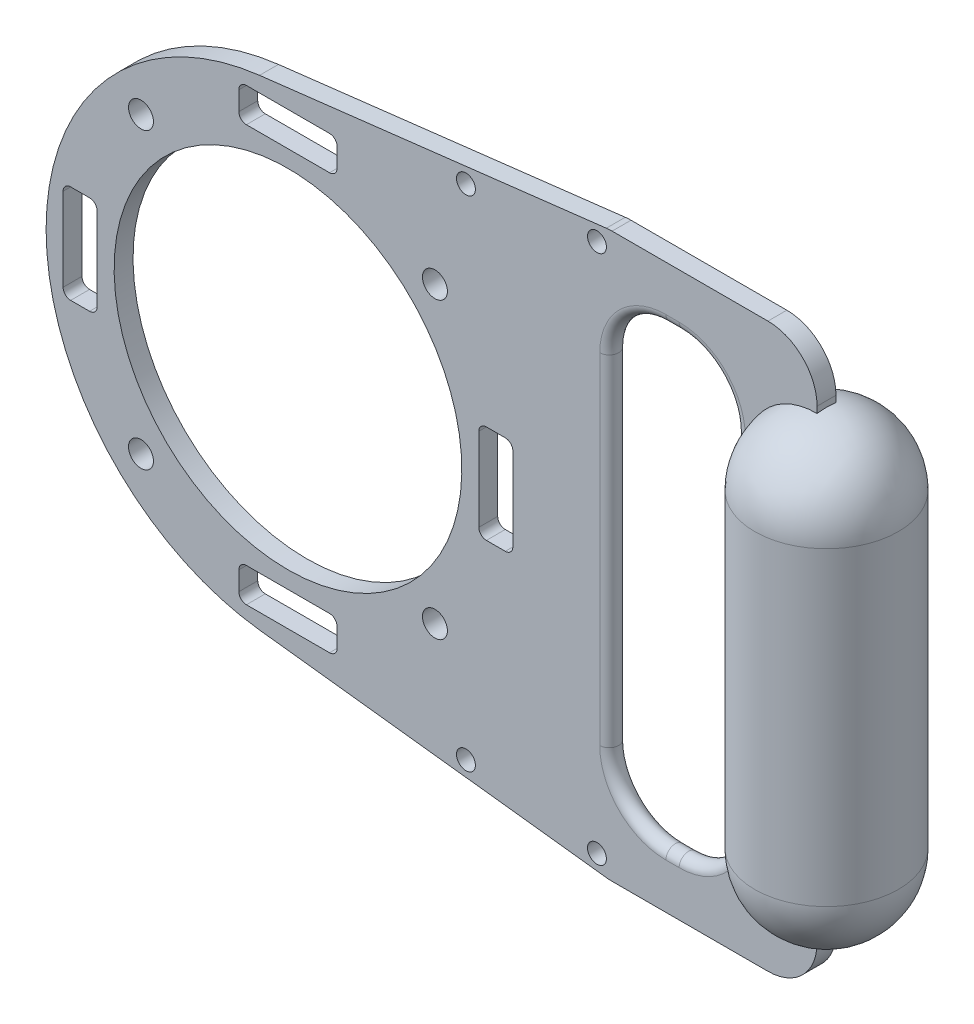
ISO-10303-21;
HEADER;
FILE_DESCRIPTION(('STEP AP214'),'2;1');
FILE_NAME('part.step','',(''),(''),'','','');
FILE_SCHEMA(('AUTOMOTIVE_DESIGN { 1 0 10303 214 1 1 1 1 }'));
ENDSEC;
DATA;
#1=APPLICATION_CONTEXT('core data for automotive mechanical design processes');
#2=APPLICATION_PROTOCOL_DEFINITION('international standard','automotive_design',2000,#1);
#3=PRODUCT_CONTEXT('',#1,'mechanical');
#4=PRODUCT('Part','Part','',(#3));
#5=PRODUCT_RELATED_PRODUCT_CATEGORY('part','',(#4));
#6=PRODUCT_DEFINITION_FORMATION('','',#4);
#7=PRODUCT_DEFINITION_CONTEXT('part definition',#1,'design');
#8=PRODUCT_DEFINITION('design','',#6,#7);
#9=PRODUCT_DEFINITION_SHAPE('','',#8);
#10=(LENGTH_UNIT() NAMED_UNIT(*) SI_UNIT(.MILLI.,.METRE.));
#11=(NAMED_UNIT(*) PLANE_ANGLE_UNIT() SI_UNIT($,.RADIAN.));
#12=(NAMED_UNIT(*) SI_UNIT($,.STERADIAN.) SOLID_ANGLE_UNIT());
#13=UNCERTAINTY_MEASURE_WITH_UNIT(LENGTH_MEASURE(1.E-05),#10,'distance_accuracy_value','');
#14=(GEOMETRIC_REPRESENTATION_CONTEXT(3) GLOBAL_UNCERTAINTY_ASSIGNED_CONTEXT((#13)) GLOBAL_UNIT_ASSIGNED_CONTEXT((#10,
#11,#12)) REPRESENTATION_CONTEXT('',''));
#15=CARTESIAN_POINT('',(0.,0.,0.));
#16=DIRECTION('',(0.,0.,1.));
#17=DIRECTION('',(1.,0.,0.));
#18=AXIS2_PLACEMENT_3D('',#15,#16,#17);
#19=CARTESIAN_POINT('',(0.,0.,0.));
#20=DIRECTION('',(0.,0.,1.));
#21=DIRECTION('',(0.,1.,0.));
#22=AXIS2_PLACEMENT_3D('',#19,#20,#21);
#23=PLANE('',#22);
#24=DIRECTION('',(0.,-1.,0.));
#25=VECTOR('',#24,1.);
#26=CARTESIAN_POINT('',(140.,0.,0.));
#27=LINE('',#26,#25);
#28=CARTESIAN_POINT('',(140.,61.5,0.));
#29=VERTEX_POINT('',#28);
#30=CARTESIAN_POINT('',(140.,59.8348082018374,0.));
#31=VERTEX_POINT('',#30);
#32=EDGE_CURVE('E322',#29,#31,#27,.T.);
#33=ORIENTED_EDGE('',*,*,#32,.T.);
#34=CARTESIAN_POINT('',(140.,59.8348082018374,0.));
#35=CARTESIAN_POINT('',(139.646831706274,59.8348194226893,0.));
#36=CARTESIAN_POINT('',(139.293664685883,59.82487532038,0.));
#37=CARTESIAN_POINT('',(138.588464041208,59.7851581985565,0.));
#38=CARTESIAN_POINT('',(138.236430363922,59.7553861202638,0.));
#39=CARTESIAN_POINT('',(137.534599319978,59.6760954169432,0.));
#40=CARTESIAN_POINT('',(137.184801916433,59.6265771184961,0.));
#41=CARTESIAN_POINT('',(136.488806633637,59.5079993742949,0.));
#42=CARTESIAN_POINT('',(136.142606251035,59.4389546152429,0.));
#43=CARTESIAN_POINT('',(135.454629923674,59.2815241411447,0.));
#44=CARTESIAN_POINT('',(135.112853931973,59.193138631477,0.));
#45=CARTESIAN_POINT('',(134.434826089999,58.9973160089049,0.));
#46=CARTESIAN_POINT('',(134.098574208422,58.8898790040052,0.));
#47=CARTESIAN_POINT('',(133.265942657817,58.5978045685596,0.));
#48=CARTESIAN_POINT('',(132.773630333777,58.401437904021,0.));
#49=CARTESIAN_POINT('',(131.807222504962,57.9678783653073,0.));
#50=CARTESIAN_POINT('',(131.333129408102,57.7306801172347,0.));
#51=CARTESIAN_POINT('',(130.638365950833,57.3456408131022,0.));
#52=CARTESIAN_POINT('',(130.409493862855,57.2124115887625,0.));
#53=CARTESIAN_POINT('',(129.957632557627,56.9364651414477,0.));
#54=CARTESIAN_POINT('',(129.73464170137,56.7937506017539,0.));
#55=CARTESIAN_POINT('',(129.074953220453,56.3516610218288,0.));
#56=CARTESIAN_POINT('',(128.647499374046,56.0383176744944,0.));
#57=CARTESIAN_POINT('',(127.820566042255,55.3767814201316,0.));
#58=CARTESIAN_POINT('',(127.421086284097,55.0285888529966,0.));
#59=CARTESIAN_POINT('',(126.652858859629,54.2997788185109,0.));
#60=CARTESIAN_POINT('',(126.284111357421,53.9191611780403,0.));
#61=CARTESIAN_POINT('',(125.579921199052,53.1281407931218,0.));
#62=CARTESIAN_POINT('',(125.244485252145,52.7177320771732,0.));
#63=CARTESIAN_POINT('',(124.609387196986,51.8701184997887,0.));
#64=CARTESIAN_POINT('',(124.309724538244,51.4329140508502,0.));
#65=CARTESIAN_POINT('',(123.748250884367,50.534736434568,0.));
#66=CARTESIAN_POINT('',(123.486446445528,50.0737591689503,0.));
#67=CARTESIAN_POINT('',(123.002597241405,49.1313507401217,0.));
#68=CARTESIAN_POINT('',(122.780554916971,48.6499183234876,0.));
#69=CARTESIAN_POINT('',(122.377932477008,47.6703120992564,0.));
#70=CARTESIAN_POINT('',(122.197331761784,47.1721467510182,0.));
#71=CARTESIAN_POINT('',(121.878762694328,46.1624467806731,0.));
#72=CARTESIAN_POINT('',(121.74078409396,45.6509154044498,0.));
#73=CARTESIAN_POINT('',(121.548281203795,44.7953951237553,0.));
#74=CARTESIAN_POINT('',(121.481366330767,44.4541399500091,0.));
#75=CARTESIAN_POINT('',(121.366523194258,43.7684549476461,0.));
#76=CARTESIAN_POINT('',(121.318593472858,43.4240253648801,0.));
#77=CARTESIAN_POINT('',(121.241929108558,42.7335617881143,0.));
#78=CARTESIAN_POINT('',(121.213165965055,42.3875309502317,0.));
#79=CARTESIAN_POINT('',(121.174790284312,41.6943347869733,0.));
#80=CARTESIAN_POINT('',(121.165181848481,41.3471692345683,0.));
#81=CARTESIAN_POINT('',(121.165191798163,41.,0.));
#82=B_SPLINE_CURVE_WITH_KNOTS('',3,(#34,#35,#36,#37,#38,#39,#40,#41,#42,#43,#44,#45,#46,#47,#48,
#49,#50,#51,#52,#53,#54,#55,#56,#57,#58,#59,#60,#61,#62,#63,#64,#65,#66,#67,#68,#69,#70,#71,#72,
#73,#74,#75,#76,#77,#78,#79,#80,#81),.UNSPECIFIED.,.F.,.F.,(4,2,2,2,2,2,2,2,2,2,2,2,2,2,2,2,2,2,
2,2,2,2,2,4),(0.,1.0593629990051,2.11867571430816,3.17797091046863,4.23647147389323,
5.29496079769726,6.35344412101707,7.9415790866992,9.52992322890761,10.3241934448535,
11.1182399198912,12.7061950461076,14.2941346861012,15.8820828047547,17.4703501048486,
19.0585929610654,20.647110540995,22.2357256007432,23.8235492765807,25.4109908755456,
26.4537699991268,27.4964690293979,28.5376140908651,29.578982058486),.UNSPECIFIED.);
#83=CARTESIAN_POINT('',(121.165191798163,41.,0.));
#84=VERTEX_POINT('',#83);
#85=EDGE_CURVE('E9',#31,#84,#82,.T.);
#86=ORIENTED_EDGE('',*,*,#85,.T.);
#87=DIRECTION('',(0.,-1.,0.));
#88=VECTOR('',#87,1.);
#89=CARTESIAN_POINT('',(121.165191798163,60.,0.));
#90=LINE('',#89,#88);
#91=CARTESIAN_POINT('',(121.165191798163,-41.,0.));
#92=VERTEX_POINT('',#91);
#93=EDGE_CURVE('E33',#84,#92,#90,.T.);
#94=ORIENTED_EDGE('',*,*,#93,.T.);
#95=CARTESIAN_POINT('',(121.165191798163,-41.,0.));
#96=CARTESIAN_POINT('',(121.165192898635,-41.318637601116,0.));
#97=CARTESIAN_POINT('',(121.173279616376,-41.6372153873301,0.));
#98=CARTESIAN_POINT('',(121.205596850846,-42.2735604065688,0.));
#99=CARTESIAN_POINT('',(121.229827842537,-42.5913276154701,0.));
#100=CARTESIAN_POINT('',(121.326775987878,-43.5431403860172,0.));
#101=CARTESIAN_POINT('',(121.423748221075,-44.1748978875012,0.));
#102=CARTESIAN_POINT('',(121.659297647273,-45.3184510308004,0.));
#103=CARTESIAN_POINT('',(121.787953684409,-45.8323239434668,0.));
#104=CARTESIAN_POINT('',(122.013014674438,-46.5936065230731,0.));
#105=CARTESIAN_POINT('',(122.093398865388,-46.8458250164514,0.));
#106=CARTESIAN_POINT('',(122.264744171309,-47.3467150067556,0.));
#107=CARTESIAN_POINT('',(122.355708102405,-47.5953855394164,0.));
#108=CARTESIAN_POINT('',(122.644288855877,-48.3355098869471,0.));
#109=CARTESIAN_POINT('',(122.857559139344,-48.820956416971,0.));
#110=CARTESIAN_POINT('',(123.324263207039,-49.7721403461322,0.));
#111=CARTESIAN_POINT('',(123.577696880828,-50.2378777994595,0.));
#112=CARTESIAN_POINT('',(123.986519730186,-50.9191047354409,0.));
#113=CARTESIAN_POINT('',(124.127581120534,-51.143295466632,0.));
#114=CARTESIAN_POINT('',(124.418990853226,-51.5854735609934,0.));
#115=CARTESIAN_POINT('',(124.569336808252,-51.8034624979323,0.));
#116=CARTESIAN_POINT('',(125.034000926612,-52.4476698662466,0.));
#117=CARTESIAN_POINT('',(125.361966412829,-52.8641639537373,0.));
#118=CARTESIAN_POINT('',(126.051693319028,-53.6678793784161,0.));
#119=CARTESIAN_POINT('',(126.413445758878,-54.0551084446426,0.));
#120=CARTESIAN_POINT('',(127.168275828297,-54.797723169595,0.));
#121=CARTESIAN_POINT('',(127.561353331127,-55.1531089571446,0.));
#122=CARTESIAN_POINT('',(128.376099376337,-55.8295378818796,0.));
#123=CARTESIAN_POINT('',(128.797767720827,-56.1505812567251,0.));
#124=CARTESIAN_POINT('',(129.449279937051,-56.6045645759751,0.));
#125=CARTESIAN_POINT('',(129.669628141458,-56.7513007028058,0.));
#126=CARTESIAN_POINT('',(130.116374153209,-57.0353992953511,0.));
#127=CARTESIAN_POINT('',(130.342773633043,-57.172759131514,0.));
#128=CARTESIAN_POINT('',(131.030430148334,-57.57036940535,0.));
#129=CARTESIAN_POINT('',(131.500155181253,-57.8161575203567,0.));
#130=CARTESIAN_POINT('',(132.458569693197,-58.2672327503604,0.));
#131=CARTESIAN_POINT('',(132.947256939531,-58.4725246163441,0.));
#132=CARTESIAN_POINT('',(133.792189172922,-58.7862691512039,0.));
#133=CARTESIAN_POINT('',(134.144524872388,-58.9053524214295,0.));
#134=CARTESIAN_POINT('',(134.855662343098,-59.1224718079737,0.));
#135=CARTESIAN_POINT('',(135.214464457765,-59.2205068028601,0.));
#136=CARTESIAN_POINT('',(135.937250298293,-59.3951708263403,0.));
#137=CARTESIAN_POINT('',(136.301234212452,-59.471799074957,0.));
#138=CARTESIAN_POINT('',(137.033565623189,-59.6034636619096,0.));
#139=CARTESIAN_POINT('',(137.401918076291,-59.6584724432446,0.));
#140=CARTESIAN_POINT('',(138.141234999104,-59.7465608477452,0.));
#141=CARTESIAN_POINT('',(138.512199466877,-59.7796404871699,0.));
#142=CARTESIAN_POINT('',(139.255442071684,-59.8237712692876,0.));
#143=CARTESIAN_POINT('',(139.627720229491,-59.8348220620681,0.));
#144=CARTESIAN_POINT('',(140.,-59.8348082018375,0.));
#145=B_SPLINE_CURVE_WITH_KNOTS('',3,(#95,#96,#97,#98,#99,#100,#101,#102,#103,#104,#105,#106,
#107,#108,#109,#110,#111,#112,#113,#114,#115,#116,#117,#118,#119,#120,#121,#122,#123,#124,#125,
#126,#127,#128,#129,#130,#131,#132,#133,#134,#135,#136,#137,#138,#139,#140,#141,#142,#143,#144),
.UNSPECIFIED.,.F.,.F.,(4,2,2,2,2,2,2,2,2,2,2,2,2,2,2,2,2,2,2,2,2,2,2,2,4),(0.,0.955690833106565,
1.91140978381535,3.82523423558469,5.41253371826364,6.20647504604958,7.00062819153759,
8.58930878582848,10.1779850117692,10.972408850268,11.7666292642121,13.3549476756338,
14.942845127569,16.5307361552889,18.1186161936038,18.9126196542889,19.7068448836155,
21.2952591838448,22.8834870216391,23.99862606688,25.1138245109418,26.2290635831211,
27.3457196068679,28.4623748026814,29.5790477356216),.UNSPECIFIED.);
#146=CARTESIAN_POINT('',(140.,-59.8348082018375,0.));
#147=VERTEX_POINT('',#146);
#148=EDGE_CURVE('E25',#92,#147,#145,.T.);
#149=ORIENTED_EDGE('',*,*,#148,.T.);
#150=CARTESIAN_POINT('',(140.,-61.5,0.));
#151=VERTEX_POINT('',#150);
#152=EDGE_CURVE('E326',#147,#151,#27,.T.);
#153=ORIENTED_EDGE('',*,*,#152,.T.);
#154=CARTESIAN_POINT('',(127.,-61.5,0.));
#155=DIRECTION('',(0.,0.,-1.));
#156=DIRECTION('',(0.,-1.,0.));
#157=AXIS2_PLACEMENT_3D('',#154,#155,#156);
#158=CIRCLE('',#157,13.);
#159=CARTESIAN_POINT('',(127.,-74.5,0.));
#160=VERTEX_POINT('',#159);
#161=EDGE_CURVE('E327',#160,#151,#158,.F.);
#162=ORIENTED_EDGE('',*,*,#161,.F.);
#163=DIRECTION('',(-1.,0.,0.));
#164=VECTOR('',#163,1.);
#165=CARTESIAN_POINT('',(0.,-74.5,0.));
#166=LINE('',#165,#164);
#167=CARTESIAN_POINT('',(85.7661545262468,-74.5,0.));
#168=VERTEX_POINT('',#167);
#169=EDGE_CURVE('E334',#160,#168,#166,.T.);
#170=ORIENTED_EDGE('',*,*,#169,.T.);
#171=CARTESIAN_POINT('',(85.7661545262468,-61.5,0.));
#172=DIRECTION('',(0.,0.,1.));
#173=DIRECTION('',(0.,1.,0.));
#174=AXIS2_PLACEMENT_3D('',#171,#172,#173);
#175=CIRCLE('',#174,13.);
#176=CARTESIAN_POINT('',(84.2391492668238,-74.4100060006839,0.));
#177=VERTEX_POINT('',#176);
#178=EDGE_CURVE('E557',#177,#168,#175,.T.);
#179=ORIENTED_EDGE('',*,*,#178,.F.);
#180=DIRECTION('',(0.993077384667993,-0.117461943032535,0.));
#181=VECTOR('',#180,1.);
#182=CARTESIAN_POINT('',(-7.51756435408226,-63.5569526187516,0.));
#183=LINE('',#182,#181);
#184=CARTESIAN_POINT('',(-7.51756435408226,-63.5569526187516,0.));
#185=VERTEX_POINT('',#184);
#186=EDGE_CURVE('E341',#185,#177,#183,.T.);
#187=ORIENTED_EDGE('',*,*,#186,.F.);
#188=CARTESIAN_POINT('',(0.,0.,0.));
#189=DIRECTION('',(0.,0.,-1.));
#190=DIRECTION('',(0.,-1.,0.));
#191=AXIS2_PLACEMENT_3D('',#188,#189,#190);
#192=CIRCLE('',#191,64.);
#193=CARTESIAN_POINT('',(-7.51756435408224,63.5569526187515,0.));
#194=VERTEX_POINT('',#193);
#195=EDGE_CURVE('E345',#194,#185,#192,.F.);
#196=ORIENTED_EDGE('',*,*,#195,.F.);
#197=DIRECTION('',(-0.993077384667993,-0.117461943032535,0.));
#198=VECTOR('',#197,1.);
#199=CARTESIAN_POINT('',(-7.51756435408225,63.5569526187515,0.));
#200=LINE('',#199,#198);
#201=CARTESIAN_POINT('',(84.2391492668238,74.4100060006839,0.));
#202=VERTEX_POINT('',#201);
#203=EDGE_CURVE('E349',#202,#194,#200,.T.);
#204=ORIENTED_EDGE('',*,*,#203,.F.);
#205=CARTESIAN_POINT('',(85.7661545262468,61.5,0.));
#206=DIRECTION('',(0.,0.,1.));
#207=DIRECTION('',(0.,1.,0.));
#208=AXIS2_PLACEMENT_3D('',#205,#206,#207);
#209=CIRCLE('',#208,13.);
#210=CARTESIAN_POINT('',(85.7661545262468,74.5,0.));
#211=VERTEX_POINT('',#210);
#212=EDGE_CURVE('E559',#211,#202,#209,.T.);
#213=ORIENTED_EDGE('',*,*,#212,.F.);
#214=DIRECTION('',(-1.,0.,0.));
#215=VECTOR('',#214,1.);
#216=CARTESIAN_POINT('',(0.,74.5,0.));
#217=LINE('',#216,#215);
#218=CARTESIAN_POINT('',(127.,74.5,0.));
#219=VERTEX_POINT('',#218);
#220=EDGE_CURVE('E350',#211,#219,#217,.F.);
#221=ORIENTED_EDGE('',*,*,#220,.T.);
#222=CARTESIAN_POINT('',(127.,61.5,0.));
#223=DIRECTION('',(0.,0.,-1.));
#224=DIRECTION('',(0.,-1.,0.));
#225=AXIS2_PLACEMENT_3D('',#222,#223,#224);
#226=CIRCLE('',#225,13.);
#227=EDGE_CURVE('E318',#29,#219,#226,.F.);
#228=ORIENTED_EDGE('',*,*,#227,.F.);
#229=EDGE_LOOP('',(#33,#86,#94,#149,#153,#162,#170,#179,#187,#196,#204,#213,#221,#228));
#230=FACE_BOUND('',#229,.T.);
#231=CARTESIAN_POINT('',(52.5,10.9999999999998,0.));
#232=DIRECTION('',(0.,0.,1.));
#233=DIRECTION('',(0.,1.,0.));
#234=AXIS2_PLACEMENT_3D('',#231,#232,#233);
#235=CIRCLE('',#234,2.);
#236=CARTESIAN_POINT('',(52.5,12.9999999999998,0.));
#237=VERTEX_POINT('',#236);
#238=CARTESIAN_POINT('',(50.5,10.9999999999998,0.));
#239=VERTEX_POINT('',#238);
#240=EDGE_CURVE('E198',#237,#239,#235,.T.);
#241=ORIENTED_EDGE('',*,*,#240,.T.);
#242=DIRECTION('',(0.,1.,0.));
#243=VECTOR('',#242,1.);
#244=CARTESIAN_POINT('',(50.5,-1.93413180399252E-13,0.));
#245=LINE('',#244,#243);
#246=CARTESIAN_POINT('',(50.5,-11.0000000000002,0.));
#247=VERTEX_POINT('',#246);
#248=EDGE_CURVE('E202',#247,#239,#245,.T.);
#249=ORIENTED_EDGE('',*,*,#248,.F.);
#250=CARTESIAN_POINT('',(52.5,-11.0000000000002,0.));
#251=DIRECTION('',(0.,0.,-1.));
#252=DIRECTION('',(0.,-1.,0.));
#253=AXIS2_PLACEMENT_3D('',#250,#251,#252);
#254=CIRCLE('',#253,2.);
#255=CARTESIAN_POINT('',(52.5,-13.0000000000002,0.));
#256=VERTEX_POINT('',#255);
#257=EDGE_CURVE('E206',#247,#256,#254,.F.);
#258=ORIENTED_EDGE('',*,*,#257,.T.);
#259=DIRECTION('',(-1.,0.,0.));
#260=VECTOR('',#259,1.);
#261=CARTESIAN_POINT('',(0.,-13.,0.));
#262=LINE('',#261,#260);
#263=CARTESIAN_POINT('',(57.5,-13.0000000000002,0.));
#264=VERTEX_POINT('',#263);
#265=EDGE_CURVE('E213',#264,#256,#262,.T.);
#266=ORIENTED_EDGE('',*,*,#265,.F.);
#267=CARTESIAN_POINT('',(57.5,-11.0000000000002,0.));
#268=DIRECTION('',(0.,0.,1.));
#269=DIRECTION('',(0.,1.,0.));
#270=AXIS2_PLACEMENT_3D('',#267,#268,#269);
#271=CIRCLE('',#270,2.);
#272=CARTESIAN_POINT('',(59.5,-11.0000000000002,0.));
#273=VERTEX_POINT('',#272);
#274=EDGE_CURVE('E217',#264,#273,#271,.T.);
#275=ORIENTED_EDGE('',*,*,#274,.T.);
#276=DIRECTION('',(0.,1.,0.));
#277=VECTOR('',#276,1.);
#278=CARTESIAN_POINT('',(59.5,-2.27882856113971E-13,0.));
#279=LINE('',#278,#277);
#280=CARTESIAN_POINT('',(59.5,10.9999999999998,0.));
#281=VERTEX_POINT('',#280);
#282=EDGE_CURVE('E218',#273,#281,#279,.T.);
#283=ORIENTED_EDGE('',*,*,#282,.T.);
#284=CARTESIAN_POINT('',(57.5,10.9999999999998,0.));
#285=DIRECTION('',(0.,0.,-1.));
#286=DIRECTION('',(0.,-1.,0.));
#287=AXIS2_PLACEMENT_3D('',#284,#285,#286);
#288=CIRCLE('',#287,2.);
#289=CARTESIAN_POINT('',(57.5,12.9999999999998,0.));
#290=VERTEX_POINT('',#289);
#291=EDGE_CURVE('E194',#281,#290,#288,.F.);
#292=ORIENTED_EDGE('',*,*,#291,.T.);
#293=DIRECTION('',(-1.,0.,0.));
#294=VECTOR('',#293,1.);
#295=CARTESIAN_POINT('',(0.,13.,0.));
#296=LINE('',#295,#294);
#297=EDGE_CURVE('E191',#290,#237,#296,.T.);
#298=ORIENTED_EDGE('',*,*,#297,.T.);
#299=EDGE_LOOP('',(#241,#249,#258,#266,#275,#283,#292,#298));
#300=FACE_BOUND('',#299,.T.);
#301=CARTESIAN_POINT('',(-52.5,-10.9999999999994,0.));
#302=DIRECTION('',(0.,0.,1.));
#303=DIRECTION('',(0.,1.,0.));
#304=AXIS2_PLACEMENT_3D('',#301,#302,#303);
#305=CIRCLE('',#304,2.);
#306=CARTESIAN_POINT('',(-52.5,-12.9999999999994,0.));
#307=VERTEX_POINT('',#306);
#308=CARTESIAN_POINT('',(-50.5,-10.9999999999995,0.));
#309=VERTEX_POINT('',#308);
#310=EDGE_CURVE('E262',#307,#309,#305,.T.);
#311=ORIENTED_EDGE('',*,*,#310,.T.);
#312=DIRECTION('',(0.,-1.,0.));
#313=VECTOR('',#312,1.);
#314=CARTESIAN_POINT('',(-50.5,5.46052795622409E-13,0.));
#315=LINE('',#314,#313);
#316=CARTESIAN_POINT('',(-50.5,11.0000000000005,0.));
#317=VERTEX_POINT('',#316);
#318=EDGE_CURVE('E266',#317,#309,#315,.T.);
#319=ORIENTED_EDGE('',*,*,#318,.F.);
#320=CARTESIAN_POINT('',(-52.5,11.0000000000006,0.));
#321=DIRECTION('',(0.,0.,-1.));
#322=DIRECTION('',(0.,-1.,0.));
#323=AXIS2_PLACEMENT_3D('',#320,#321,#322);
#324=CIRCLE('',#323,2.);
#325=CARTESIAN_POINT('',(-52.5,13.0000000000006,0.));
#326=VERTEX_POINT('',#325);
#327=EDGE_CURVE('E270',#317,#326,#324,.F.);
#328=ORIENTED_EDGE('',*,*,#327,.T.);
#329=DIRECTION('',(1.,0.,0.));
#330=VECTOR('',#329,1.);
#331=CARTESIAN_POINT('',(1.40568046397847E-13,13.,0.));
#332=LINE('',#331,#330);
#333=CARTESIAN_POINT('',(-57.5,13.0000000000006,0.));
#334=VERTEX_POINT('',#333);
#335=EDGE_CURVE('E277',#334,#326,#332,.T.);
#336=ORIENTED_EDGE('',*,*,#335,.F.);
#337=CARTESIAN_POINT('',(-57.5,11.0000000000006,0.));
#338=DIRECTION('',(0.,0.,1.));
#339=DIRECTION('',(0.,1.,0.));
#340=AXIS2_PLACEMENT_3D('',#337,#338,#339);
#341=CIRCLE('',#340,2.);
#342=CARTESIAN_POINT('',(-59.5,11.0000000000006,0.));
#343=VERTEX_POINT('',#342);
#344=EDGE_CURVE('E281',#334,#343,#341,.T.);
#345=ORIENTED_EDGE('',*,*,#344,.T.);
#346=DIRECTION('',(0.,-1.,0.));
#347=VECTOR('',#346,1.);
#348=CARTESIAN_POINT('',(-59.5,6.43369135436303E-13,0.));
#349=LINE('',#348,#347);
#350=CARTESIAN_POINT('',(-59.5,-10.9999999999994,0.));
#351=VERTEX_POINT('',#350);
#352=EDGE_CURVE('E282',#343,#351,#349,.T.);
#353=ORIENTED_EDGE('',*,*,#352,.T.);
#354=CARTESIAN_POINT('',(-57.5,-10.9999999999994,0.));
#355=DIRECTION('',(0.,0.,-1.));
#356=DIRECTION('',(0.,-1.,0.));
#357=AXIS2_PLACEMENT_3D('',#354,#355,#356);
#358=CIRCLE('',#357,2.);
#359=CARTESIAN_POINT('',(-57.5,-12.9999999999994,0.));
#360=VERTEX_POINT('',#359);
#361=EDGE_CURVE('E258',#351,#360,#358,.F.);
#362=ORIENTED_EDGE('',*,*,#361,.T.);
#363=DIRECTION('',(1.,0.,0.));
#364=VECTOR('',#363,1.);
#365=CARTESIAN_POINT('',(-1.40568046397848E-13,-13.,0.));
#366=LINE('',#365,#364);
#367=EDGE_CURVE('E255',#360,#307,#366,.T.);
#368=ORIENTED_EDGE('',*,*,#367,.T.);
#369=EDGE_LOOP('',(#311,#319,#328,#336,#345,#353,#362,#368));
#370=FACE_BOUND('',#369,.T.);
#371=CARTESIAN_POINT('',(0.,0.,0.));
#372=DIRECTION('',(0.,0.,-1.));
#373=DIRECTION('',(0.,-1.,0.));
#374=AXIS2_PLACEMENT_3D('',#371,#372,#373);
#375=CIRCLE('',#374,46.);
#376=CARTESIAN_POINT('',(0.,-46.,0.));
#377=VERTEX_POINT('',#376);
#378=EDGE_CURVE('E354',#377,#377,#375,.F.);
#379=ORIENTED_EDGE('',*,*,#378,.T.);
#380=EDGE_LOOP('',(#379));
#381=FACE_BOUND('',#380,.T.);
#382=CARTESIAN_POINT('',(-38.8908729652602,-38.8908729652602,0.));
#383=DIRECTION('',(0.,0.,1.));
#384=DIRECTION('',(0.,1.,0.));
#385=AXIS2_PLACEMENT_3D('',#382,#383,#384);
#386=CIRCLE('',#385,3.3);
#387=CARTESIAN_POINT('',(-38.8908729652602,-35.5908729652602,0.));
#388=VERTEX_POINT('',#387);
#389=EDGE_CURVE('E764',#388,#388,#386,.T.);
#390=ORIENTED_EDGE('',*,*,#389,.T.);
#391=EDGE_LOOP('',(#390));
#392=FACE_BOUND('',#391,.T.);
#393=CARTESIAN_POINT('',(38.8908729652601,-38.8908729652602,0.));
#394=DIRECTION('',(0.,0.,1.));
#395=DIRECTION('',(0.,1.,0.));
#396=AXIS2_PLACEMENT_3D('',#393,#394,#395);
#397=CIRCLE('',#396,3.3);
#398=CARTESIAN_POINT('',(38.8908729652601,-35.5908729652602,0.));
#399=VERTEX_POINT('',#398);
#400=EDGE_CURVE('E767',#399,#399,#397,.T.);
#401=ORIENTED_EDGE('',*,*,#400,.T.);
#402=EDGE_LOOP('',(#401));
#403=FACE_BOUND('',#402,.T.);
#404=CARTESIAN_POINT('',(38.8908729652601,38.8908729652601,0.));
#405=DIRECTION('',(0.,0.,1.));
#406=DIRECTION('',(0.,1.,0.));
#407=AXIS2_PLACEMENT_3D('',#404,#405,#406);
#408=CIRCLE('',#407,3.3);
#409=CARTESIAN_POINT('',(38.8908729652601,42.1908729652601,0.));
#410=VERTEX_POINT('',#409);
#411=EDGE_CURVE('E770',#410,#410,#408,.T.);
#412=ORIENTED_EDGE('',*,*,#411,.T.);
#413=EDGE_LOOP('',(#412));
#414=FACE_BOUND('',#413,.T.);
#415=CARTESIAN_POINT('',(-38.8908729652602,38.8908729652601,0.));
#416=DIRECTION('',(0.,0.,1.));
#417=DIRECTION('',(0.,1.,0.));
#418=AXIS2_PLACEMENT_3D('',#415,#416,#417);
#419=CIRCLE('',#418,3.3);
#420=CARTESIAN_POINT('',(-38.8908729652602,42.1908729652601,0.));
#421=VERTEX_POINT('',#420);
#422=EDGE_CURVE('E773',#421,#421,#419,.T.);
#423=ORIENTED_EDGE('',*,*,#422,.T.);
#424=EDGE_LOOP('',(#423));
#425=FACE_BOUND('',#424,.T.);
#426=DIRECTION('',(-1.,0.,0.));
#427=VECTOR('',#426,1.);
#428=CARTESIAN_POINT('',(0.,62.5,0.));
#429=LINE('',#428,#427);
#430=CARTESIAN_POINT('',(100.,62.5,0.));
#431=VERTEX_POINT('',#430);
#432=CARTESIAN_POINT('',(103.5,62.5,0.));
#433=VERTEX_POINT('',#432);
#434=EDGE_CURVE('E550',#431,#433,#429,.F.);
#435=ORIENTED_EDGE('',*,*,#434,.F.);
#436=CARTESIAN_POINT('',(100.,45.,0.));
#437=DIRECTION('',(0.,0.,-1.));
#438=DIRECTION('',(-1.,0.,0.));
#439=AXIS2_PLACEMENT_3D('',#436,#437,#438);
#440=CIRCLE('',#439,17.5);
#441=CARTESIAN_POINT('',(82.5,45.,0.));
#442=VERTEX_POINT('',#441);
#443=EDGE_CURVE('E467',#442,#431,#440,.T.);
#444=ORIENTED_EDGE('',*,*,#443,.F.);
#445=DIRECTION('',(0.,1.,0.));
#446=VECTOR('',#445,1.);
#447=CARTESIAN_POINT('',(82.5,0.,0.));
#448=LINE('',#447,#446);
#449=CARTESIAN_POINT('',(82.5,-45.,0.));
#450=VERTEX_POINT('',#449);
#451=EDGE_CURVE('E564',#450,#442,#448,.T.);
#452=ORIENTED_EDGE('',*,*,#451,.F.);
#453=CARTESIAN_POINT('',(100.,-45.,0.));
#454=DIRECTION('',(0.,0.,-1.));
#455=DIRECTION('',(0.,-1.,0.));
#456=AXIS2_PLACEMENT_3D('',#453,#454,#455);
#457=CIRCLE('',#456,17.5);
#458=CARTESIAN_POINT('',(100.,-62.5,0.));
#459=VERTEX_POINT('',#458);
#460=EDGE_CURVE('E570',#459,#450,#457,.T.);
#461=ORIENTED_EDGE('',*,*,#460,.F.);
#462=DIRECTION('',(-1.,0.,0.));
#463=VECTOR('',#462,1.);
#464=CARTESIAN_POINT('',(0.,-62.5,0.));
#465=LINE('',#464,#463);
#466=CARTESIAN_POINT('',(103.5,-62.5,0.));
#467=VERTEX_POINT('',#466);
#468=EDGE_CURVE('E573',#467,#459,#465,.T.);
#469=ORIENTED_EDGE('',*,*,#468,.F.);
#470=CARTESIAN_POINT('',(103.5,-45.,0.));
#471=DIRECTION('',(0.,0.,-1.));
#472=DIRECTION('',(1.,0.,0.));
#473=AXIS2_PLACEMENT_3D('',#470,#471,#472);
#474=CIRCLE('',#473,17.5);
#475=CARTESIAN_POINT('',(121.,-45.,0.));
#476=VERTEX_POINT('',#475);
#477=EDGE_CURVE('E391',#476,#467,#474,.T.);
#478=ORIENTED_EDGE('',*,*,#477,.F.);
#479=DIRECTION('',(0.,1.,0.));
#480=VECTOR('',#479,1.);
#481=CARTESIAN_POINT('',(121.,0.,0.));
#482=LINE('',#481,#480);
#483=CARTESIAN_POINT('',(121.,45.,0.));
#484=VERTEX_POINT('',#483);
#485=EDGE_CURVE('E552',#484,#476,#482,.F.);
#486=ORIENTED_EDGE('',*,*,#485,.F.);
#487=CARTESIAN_POINT('',(103.5,45.,0.));
#488=DIRECTION('',(0.,0.,-1.));
#489=DIRECTION('',(0.,1.,0.));
#490=AXIS2_PLACEMENT_3D('',#487,#488,#489);
#491=CIRCLE('',#490,17.5);
#492=EDGE_CURVE('E547',#433,#484,#491,.T.);
#493=ORIENTED_EDGE('',*,*,#492,.F.);
#494=EDGE_LOOP('',(#435,#444,#452,#461,#469,#478,#486,#493));
#495=FACE_BOUND('',#494,.T.);
#496=CARTESIAN_POINT('',(-11.,52.5,0.));
#497=DIRECTION('',(0.,0.,1.));
#498=DIRECTION('',(0.,1.,0.));
#499=AXIS2_PLACEMENT_3D('',#496,#497,#498);
#500=CIRCLE('',#499,2.);
#501=CARTESIAN_POINT('',(-13.,52.5,0.));
#502=VERTEX_POINT('',#501);
#503=CARTESIAN_POINT('',(-11.,50.5,0.));
#504=VERTEX_POINT('',#503);
#505=EDGE_CURVE('E294',#502,#504,#500,.T.);
#506=ORIENTED_EDGE('',*,*,#505,.T.);
#507=DIRECTION('',(-1.,0.,0.));
#508=VECTOR('',#507,1.);
#509=CARTESIAN_POINT('',(0.,50.5,0.));
#510=LINE('',#509,#508);
#511=CARTESIAN_POINT('',(11.,50.5,0.));
#512=VERTEX_POINT('',#511);
#513=EDGE_CURVE('E298',#512,#504,#510,.T.);
#514=ORIENTED_EDGE('',*,*,#513,.F.);
#515=CARTESIAN_POINT('',(11.,52.5,0.));
#516=DIRECTION('',(0.,0.,-1.));
#517=DIRECTION('',(0.,-1.,0.));
#518=AXIS2_PLACEMENT_3D('',#515,#516,#517);
#519=CIRCLE('',#518,2.);
#520=CARTESIAN_POINT('',(13.,52.5,0.));
#521=VERTEX_POINT('',#520);
#522=EDGE_CURVE('E302',#512,#521,#519,.F.);
#523=ORIENTED_EDGE('',*,*,#522,.T.);
#524=DIRECTION('',(0.,1.,0.));
#525=VECTOR('',#524,1.);
#526=CARTESIAN_POINT('',(13.,0.,0.));
#527=LINE('',#526,#525);
#528=CARTESIAN_POINT('',(13.,57.5,0.));
#529=VERTEX_POINT('',#528);
#530=EDGE_CURVE('E309',#529,#521,#527,.F.);
#531=ORIENTED_EDGE('',*,*,#530,.F.);
#532=CARTESIAN_POINT('',(11.,57.5,0.));
#533=DIRECTION('',(0.,0.,1.));
#534=DIRECTION('',(0.,1.,0.));
#535=AXIS2_PLACEMENT_3D('',#532,#533,#534);
#536=CIRCLE('',#535,2.);
#537=CARTESIAN_POINT('',(11.,59.5,0.));
#538=VERTEX_POINT('',#537);
#539=EDGE_CURVE('E313',#529,#538,#536,.T.);
#540=ORIENTED_EDGE('',*,*,#539,.T.);
#541=DIRECTION('',(-1.,0.,0.));
#542=VECTOR('',#541,1.);
#543=CARTESIAN_POINT('',(0.,59.5,0.));
#544=LINE('',#543,#542);
#545=CARTESIAN_POINT('',(-11.,59.5,0.));
#546=VERTEX_POINT('',#545);
#547=EDGE_CURVE('E314',#538,#546,#544,.T.);
#548=ORIENTED_EDGE('',*,*,#547,.T.);
#549=CARTESIAN_POINT('',(-11.,57.5,0.));
#550=DIRECTION('',(0.,0.,-1.));
#551=DIRECTION('',(0.,-1.,0.));
#552=AXIS2_PLACEMENT_3D('',#549,#550,#551);
#553=CIRCLE('',#552,2.);
#554=CARTESIAN_POINT('',(-13.,57.5,0.));
#555=VERTEX_POINT('',#554);
#556=EDGE_CURVE('E290',#546,#555,#553,.F.);
#557=ORIENTED_EDGE('',*,*,#556,.T.);
#558=DIRECTION('',(0.,1.,0.));
#559=VECTOR('',#558,1.);
#560=CARTESIAN_POINT('',(-13.,0.,0.));
#561=LINE('',#560,#559);
#562=EDGE_CURVE('E287',#555,#502,#561,.F.);
#563=ORIENTED_EDGE('',*,*,#562,.T.);
#564=EDGE_LOOP('',(#506,#514,#523,#531,#540,#548,#557,#563));
#565=FACE_BOUND('',#564,.T.);
#566=CARTESIAN_POINT('',(11.,-52.5,0.));
#567=DIRECTION('',(0.,0.,1.));
#568=DIRECTION('',(0.,1.,0.));
#569=AXIS2_PLACEMENT_3D('',#566,#567,#568);
#570=CIRCLE('',#569,2.);
#571=CARTESIAN_POINT('',(13.,-52.5,0.));
#572=VERTEX_POINT('',#571);
#573=CARTESIAN_POINT('',(11.,-50.5,0.));
#574=VERTEX_POINT('',#573);
#575=EDGE_CURVE('E230',#572,#574,#570,.T.);
#576=ORIENTED_EDGE('',*,*,#575,.T.);
#577=DIRECTION('',(-1.,0.,0.));
#578=VECTOR('',#577,1.);
#579=CARTESIAN_POINT('',(0.,-50.5,0.));
#580=LINE('',#579,#578);
#581=CARTESIAN_POINT('',(-11.,-50.5,0.));
#582=VERTEX_POINT('',#581);
#583=EDGE_CURVE('E234',#582,#574,#580,.F.);
#584=ORIENTED_EDGE('',*,*,#583,.F.);
#585=CARTESIAN_POINT('',(-11.,-52.5,0.));
#586=DIRECTION('',(0.,0.,-1.));
#587=DIRECTION('',(0.,-1.,0.));
#588=AXIS2_PLACEMENT_3D('',#585,#586,#587);
#589=CIRCLE('',#588,2.);
#590=CARTESIAN_POINT('',(-13.,-52.5,0.));
#591=VERTEX_POINT('',#590);
#592=EDGE_CURVE('E238',#582,#591,#589,.F.);
#593=ORIENTED_EDGE('',*,*,#592,.T.);
#594=DIRECTION('',(0.,1.,0.));
#595=VECTOR('',#594,1.);
#596=CARTESIAN_POINT('',(-13.,0.,0.));
#597=LINE('',#596,#595);
#598=CARTESIAN_POINT('',(-13.,-57.5,0.));
#599=VERTEX_POINT('',#598);
#600=EDGE_CURVE('E245',#599,#591,#597,.T.);
#601=ORIENTED_EDGE('',*,*,#600,.F.);
#602=CARTESIAN_POINT('',(-11.,-57.5,0.));
#603=DIRECTION('',(0.,0.,1.));
#604=DIRECTION('',(0.,1.,0.));
#605=AXIS2_PLACEMENT_3D('',#602,#603,#604);
#606=CIRCLE('',#605,2.);
#607=CARTESIAN_POINT('',(-11.,-59.5,0.));
#608=VERTEX_POINT('',#607);
#609=EDGE_CURVE('E249',#599,#608,#606,.T.);
#610=ORIENTED_EDGE('',*,*,#609,.T.);
#611=DIRECTION('',(-1.,0.,0.));
#612=VECTOR('',#611,1.);
#613=CARTESIAN_POINT('',(0.,-59.5,0.));
#614=LINE('',#613,#612);
#615=CARTESIAN_POINT('',(11.,-59.5,0.));
#616=VERTEX_POINT('',#615);
#617=EDGE_CURVE('E250',#608,#616,#614,.F.);
#618=ORIENTED_EDGE('',*,*,#617,.T.);
#619=CARTESIAN_POINT('',(11.,-57.5,0.));
#620=DIRECTION('',(0.,0.,-1.));
#621=DIRECTION('',(0.,-1.,0.));
#622=AXIS2_PLACEMENT_3D('',#619,#620,#621);
#623=CIRCLE('',#622,2.);
#624=CARTESIAN_POINT('',(13.,-57.5,0.));
#625=VERTEX_POINT('',#624);
#626=EDGE_CURVE('E226',#616,#625,#623,.F.);
#627=ORIENTED_EDGE('',*,*,#626,.T.);
#628=DIRECTION('',(0.,1.,0.));
#629=VECTOR('',#628,1.);
#630=CARTESIAN_POINT('',(13.,0.,0.));
#631=LINE('',#630,#629);
#632=EDGE_CURVE('E223',#625,#572,#631,.T.);
#633=ORIENTED_EDGE('',*,*,#632,.T.);
#634=EDGE_LOOP('',(#576,#584,#593,#601,#610,#618,#627,#633));
#635=FACE_BOUND('',#634,.T.);
#636=CARTESIAN_POINT('',(47.0936363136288,65.9885231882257,0.));
#637=DIRECTION('',(0.,0.,1.));
#638=DIRECTION('',(0.,1.,0.));
#639=AXIS2_PLACEMENT_3D('',#636,#637,#638);
#640=CIRCLE('',#639,2.5);
#641=CARTESIAN_POINT('',(47.0936363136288,68.4885231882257,0.));
#642=VERTEX_POINT('',#641);
#643=EDGE_CURVE('E501',#642,#642,#640,.T.);
#644=ORIENTED_EDGE('',*,*,#643,.T.);
#645=EDGE_LOOP('',(#644));
#646=FACE_BOUND('',#645,.T.);
#647=CARTESIAN_POINT('',(81.7607916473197,70.0889805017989,0.));
#648=DIRECTION('',(0.,0.,1.));
#649=DIRECTION('',(0.,1.,0.));
#650=AXIS2_PLACEMENT_3D('',#647,#648,#649);
#651=CIRCLE('',#650,2.5);
#652=CARTESIAN_POINT('',(81.7607916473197,72.5889805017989,0.));
#653=VERTEX_POINT('',#652);
#654=EDGE_CURVE('E779',#653,#653,#651,.T.);
#655=ORIENTED_EDGE('',*,*,#654,.T.);
#656=EDGE_LOOP('',(#655));
#657=FACE_BOUND('',#656,.T.);
#658=CARTESIAN_POINT('',(81.7607916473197,-70.0889805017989,0.));
#659=DIRECTION('',(0.,0.,1.));
#660=DIRECTION('',(0.,1.,0.));
#661=AXIS2_PLACEMENT_3D('',#658,#659,#660);
#662=CIRCLE('',#661,2.5);
#663=CARTESIAN_POINT('',(81.7607916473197,-67.5889805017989,0.));
#664=VERTEX_POINT('',#663);
#665=EDGE_CURVE('E782',#664,#664,#662,.T.);
#666=ORIENTED_EDGE('',*,*,#665,.T.);
#667=EDGE_LOOP('',(#666));
#668=FACE_BOUND('',#667,.T.);
#669=CARTESIAN_POINT('',(47.0936363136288,-65.9885231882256,0.));
#670=DIRECTION('',(0.,0.,1.));
#671=DIRECTION('',(0.,1.,0.));
#672=AXIS2_PLACEMENT_3D('',#669,#670,#671);
#673=CIRCLE('',#672,2.5);
#674=CARTESIAN_POINT('',(47.0936363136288,-63.4885231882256,0.));
#675=VERTEX_POINT('',#674);
#676=EDGE_CURVE('E785',#675,#675,#673,.T.);
#677=ORIENTED_EDGE('',*,*,#676,.T.);
#678=EDGE_LOOP('',(#677));
#679=FACE_BOUND('',#678,.T.);
#680=ADVANCED_FACE('F14',(#230,#300,#370,#381,#392,#403,#414,#425,#495,#565,#635,#646,#657,#668,
#679),#23,.F.);
#681=CARTESIAN_POINT('',(47.0936363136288,-65.9885231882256,5.));
#682=DIRECTION('',(0.,0.,1.));
#683=DIRECTION('',(0.,1.,0.));
#684=AXIS2_PLACEMENT_3D('',#681,#682,#683);
#685=CYLINDRICAL_SURFACE('',#684,2.5);
#686=CARTESIAN_POINT('',(47.0936363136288,-65.9885231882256,5.));
#687=DIRECTION('',(0.,0.,1.));
#688=DIRECTION('',(0.,1.,0.));
#689=AXIS2_PLACEMENT_3D('',#686,#687,#688);
#690=CIRCLE('',#689,2.5);
#691=CARTESIAN_POINT('',(47.0936363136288,-63.4885231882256,5.));
#692=VERTEX_POINT('',#691);
#693=EDGE_CURVE('E721',#692,#692,#690,.F.);
#694=ORIENTED_EDGE('',*,*,#693,.F.);
#695=EDGE_LOOP('',(#694));
#696=FACE_BOUND('',#695,.T.);
#697=ORIENTED_EDGE('',*,*,#676,.F.);
#698=EDGE_LOOP('',(#697));
#699=FACE_BOUND('',#698,.T.);
#700=ADVANCED_FACE('F521',(#696,#699),#685,.F.);
#701=CARTESIAN_POINT('',(81.7607916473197,-70.0889805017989,5.));
#702=DIRECTION('',(0.,0.,1.));
#703=DIRECTION('',(0.,1.,0.));
#704=AXIS2_PLACEMENT_3D('',#701,#702,#703);
#705=CYLINDRICAL_SURFACE('',#704,2.5);
#706=CARTESIAN_POINT('',(81.7607916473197,-70.0889805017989,5.));
#707=DIRECTION('',(0.,0.,1.));
#708=DIRECTION('',(0.,1.,0.));
#709=AXIS2_PLACEMENT_3D('',#706,#707,#708);
#710=CIRCLE('',#709,2.5);
#711=CARTESIAN_POINT('',(81.7607916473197,-67.5889805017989,5.));
#712=VERTEX_POINT('',#711);
#713=EDGE_CURVE('E718',#712,#712,#710,.F.);
#714=ORIENTED_EDGE('',*,*,#713,.F.);
#715=EDGE_LOOP('',(#714));
#716=FACE_BOUND('',#715,.T.);
#717=ORIENTED_EDGE('',*,*,#665,.F.);
#718=EDGE_LOOP('',(#717));
#719=FACE_BOUND('',#718,.T.);
#720=ADVANCED_FACE('F1604',(#716,#719),#705,.F.);
#721=CARTESIAN_POINT('',(81.7607916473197,70.0889805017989,5.));
#722=DIRECTION('',(0.,0.,1.));
#723=DIRECTION('',(0.,1.,0.));
#724=AXIS2_PLACEMENT_3D('',#721,#722,#723);
#725=CYLINDRICAL_SURFACE('',#724,2.5);
#726=CARTESIAN_POINT('',(81.7607916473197,70.0889805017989,5.));
#727=DIRECTION('',(0.,0.,1.));
#728=DIRECTION('',(0.,1.,0.));
#729=AXIS2_PLACEMENT_3D('',#726,#727,#728);
#730=CIRCLE('',#729,2.5);
#731=CARTESIAN_POINT('',(81.7607916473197,72.5889805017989,5.));
#732=VERTEX_POINT('',#731);
#733=EDGE_CURVE('E715',#732,#732,#730,.F.);
#734=ORIENTED_EDGE('',*,*,#733,.F.);
#735=EDGE_LOOP('',(#734));
#736=FACE_BOUND('',#735,.T.);
#737=ORIENTED_EDGE('',*,*,#654,.F.);
#738=EDGE_LOOP('',(#737));
#739=FACE_BOUND('',#738,.T.);
#740=ADVANCED_FACE('F1596',(#736,#739),#725,.F.);
#741=CARTESIAN_POINT('',(47.0936363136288,65.9885231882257,5.));
#742=DIRECTION('',(0.,0.,1.));
#743=DIRECTION('',(0.,1.,0.));
#744=AXIS2_PLACEMENT_3D('',#741,#742,#743);
#745=CYLINDRICAL_SURFACE('',#744,2.5);
#746=CARTESIAN_POINT('',(47.0936363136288,65.9885231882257,5.));
#747=DIRECTION('',(0.,0.,1.));
#748=DIRECTION('',(0.,1.,0.));
#749=AXIS2_PLACEMENT_3D('',#746,#747,#748);
#750=CIRCLE('',#749,2.5);
#751=CARTESIAN_POINT('',(47.0936363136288,68.4885231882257,5.));
#752=VERTEX_POINT('',#751);
#753=EDGE_CURVE('E184',#752,#752,#750,.F.);
#754=ORIENTED_EDGE('',*,*,#753,.F.);
#755=EDGE_LOOP('',(#754));
#756=FACE_BOUND('',#755,.T.);
#757=ORIENTED_EDGE('',*,*,#643,.F.);
#758=EDGE_LOOP('',(#757));
#759=FACE_BOUND('',#758,.T.);
#760=ADVANCED_FACE('F409',(#756,#759),#745,.F.);
#761=CARTESIAN_POINT('',(103.5,-45.,2.5));
#762=DIRECTION('',(0.,0.,1.));
#763=DIRECTION('',(0.,1.,0.));
#764=AXIS2_PLACEMENT_3D('',#761,#762,#763);
#765=TOROIDAL_SURFACE('',#764,17.5,2.5);
#766=CARTESIAN_POINT('',(121.,-45.,2.5));
#767=DIRECTION('',(0.,1.,0.));
#768=DIRECTION('',(1.,0.,0.));
#769=AXIS2_PLACEMENT_3D('',#766,#767,#768);
#770=CIRCLE('',#769,2.5);
#771=CARTESIAN_POINT('',(121.,-45.,5.));
#772=VERTEX_POINT('',#771);
#773=EDGE_CURVE('E423',#772,#476,#770,.F.);
#774=ORIENTED_EDGE('',*,*,#773,.T.);
#775=ORIENTED_EDGE('',*,*,#477,.T.);
#776=CARTESIAN_POINT('',(103.5,-62.5,2.5));
#777=DIRECTION('',(1.,0.,0.));
#778=DIRECTION('',(0.,1.,0.));
#779=AXIS2_PLACEMENT_3D('',#776,#777,#778);
#780=CIRCLE('',#779,2.5);
#781=CARTESIAN_POINT('',(103.5,-62.5,5.));
#782=VERTEX_POINT('',#781);
#783=EDGE_CURVE('E430',#782,#467,#780,.F.);
#784=ORIENTED_EDGE('',*,*,#783,.F.);
#785=CARTESIAN_POINT('',(103.5,-45.,5.));
#786=DIRECTION('',(0.,0.,1.));
#787=DIRECTION('',(0.,-1.,0.));
#788=AXIS2_PLACEMENT_3D('',#785,#786,#787);
#789=CIRCLE('',#788,17.5);
#790=EDGE_CURVE('E163',#772,#782,#789,.F.);
#791=ORIENTED_EDGE('',*,*,#790,.F.);
#792=EDGE_LOOP('',(#774,#775,#784,#791));
#793=FACE_BOUND('',#792,.T.);
#794=ADVANCED_FACE('F398',(#793),#765,.T.);
#795=CARTESIAN_POINT('',(121.,0.,2.5));
#796=DIRECTION('',(0.,1.,0.));
#797=DIRECTION('',(-1.,0.,0.));
#798=AXIS2_PLACEMENT_3D('',#795,#796,#797);
#799=CYLINDRICAL_SURFACE('',#798,2.5);
#800=CARTESIAN_POINT('',(121.,45.,2.5));
#801=DIRECTION('',(0.,1.,0.));
#802=DIRECTION('',(-1.,0.,0.));
#803=AXIS2_PLACEMENT_3D('',#800,#801,#802);
#804=CIRCLE('',#803,2.5);
#805=CARTESIAN_POINT('',(121.,45.,5.));
#806=VERTEX_POINT('',#805);
#807=EDGE_CURVE('E431',#806,#484,#804,.F.);
#808=ORIENTED_EDGE('',*,*,#807,.T.);
#809=ORIENTED_EDGE('',*,*,#485,.T.);
#810=ORIENTED_EDGE('',*,*,#773,.F.);
#811=DIRECTION('',(0.,1.,0.));
#812=VECTOR('',#811,1.);
#813=CARTESIAN_POINT('',(121.,0.,5.));
#814=LINE('',#813,#812);
#815=EDGE_CURVE('E165',#806,#772,#814,.F.);
#816=ORIENTED_EDGE('',*,*,#815,.F.);
#817=EDGE_LOOP('',(#808,#809,#810,#816));
#818=FACE_BOUND('',#817,.T.);
#819=ADVANCED_FACE('F408',(#818),#799,.T.);
#820=CARTESIAN_POINT('',(103.5,45.,2.5));
#821=DIRECTION('',(0.,0.,1.));
#822=DIRECTION('',(0.,1.,0.));
#823=AXIS2_PLACEMENT_3D('',#820,#821,#822);
#824=TOROIDAL_SURFACE('',#823,17.5,2.5);
#825=CARTESIAN_POINT('',(103.5,62.5,2.5));
#826=DIRECTION('',(-1.,0.,0.));
#827=DIRECTION('',(0.,1.,0.));
#828=AXIS2_PLACEMENT_3D('',#825,#826,#827);
#829=CIRCLE('',#828,2.5);
#830=CARTESIAN_POINT('',(103.5,62.5,5.));
#831=VERTEX_POINT('',#830);
#832=EDGE_CURVE('E435',#831,#433,#829,.F.);
#833=ORIENTED_EDGE('',*,*,#832,.T.);
#834=ORIENTED_EDGE('',*,*,#492,.T.);
#835=ORIENTED_EDGE('',*,*,#807,.F.);
#836=CARTESIAN_POINT('',(103.5,45.,5.));
#837=DIRECTION('',(0.,0.,1.));
#838=DIRECTION('',(1.,0.,0.));
#839=AXIS2_PLACEMENT_3D('',#836,#837,#838);
#840=CIRCLE('',#839,17.5);
#841=EDGE_CURVE('E174',#831,#806,#840,.F.);
#842=ORIENTED_EDGE('',*,*,#841,.F.);
#843=EDGE_LOOP('',(#833,#834,#835,#842));
#844=FACE_BOUND('',#843,.T.);
#845=ADVANCED_FACE('F442',(#844),#824,.T.);
#846=CARTESIAN_POINT('',(0.,62.5,2.5));
#847=DIRECTION('',(-1.,0.,0.));
#848=DIRECTION('',(0.,-1.,0.));
#849=AXIS2_PLACEMENT_3D('',#846,#847,#848);
#850=CYLINDRICAL_SURFACE('',#849,2.5);
#851=CARTESIAN_POINT('',(100.,62.5,2.5));
#852=DIRECTION('',(-1.,0.,0.));
#853=DIRECTION('',(0.,-1.,0.));
#854=AXIS2_PLACEMENT_3D('',#851,#852,#853);
#855=CIRCLE('',#854,2.5);
#856=CARTESIAN_POINT('',(100.,62.5,5.));
#857=VERTEX_POINT('',#856);
#858=EDGE_CURVE('E500',#857,#431,#855,.F.);
#859=ORIENTED_EDGE('',*,*,#858,.T.);
#860=ORIENTED_EDGE('',*,*,#434,.T.);
#861=ORIENTED_EDGE('',*,*,#832,.F.);
#862=DIRECTION('',(-1.,0.,0.));
#863=VECTOR('',#862,1.);
#864=CARTESIAN_POINT('',(0.,62.5,5.));
#865=LINE('',#864,#863);
#866=EDGE_CURVE('E177',#857,#831,#865,.F.);
#867=ORIENTED_EDGE('',*,*,#866,.F.);
#868=EDGE_LOOP('',(#859,#860,#861,#867));
#869=FACE_BOUND('',#868,.T.);
#870=ADVANCED_FACE('F446',(#869),#850,.T.);
#871=CARTESIAN_POINT('',(100.,45.,2.5));
#872=DIRECTION('',(0.,0.,1.));
#873=DIRECTION('',(0.,1.,0.));
#874=AXIS2_PLACEMENT_3D('',#871,#872,#873);
#875=TOROIDAL_SURFACE('',#874,17.5,2.5);
#876=CARTESIAN_POINT('',(82.5,45.,2.5));
#877=DIRECTION('',(0.,-1.,0.));
#878=DIRECTION('',(-1.,0.,0.));
#879=AXIS2_PLACEMENT_3D('',#876,#877,#878);
#880=CIRCLE('',#879,2.5);
#881=CARTESIAN_POINT('',(82.5,45.,5.));
#882=VERTEX_POINT('',#881);
#883=EDGE_CURVE('E493',#882,#442,#880,.F.);
#884=ORIENTED_EDGE('',*,*,#883,.T.);
#885=ORIENTED_EDGE('',*,*,#443,.T.);
#886=ORIENTED_EDGE('',*,*,#858,.F.);
#887=CARTESIAN_POINT('',(100.,45.,5.));
#888=DIRECTION('',(0.,0.,1.));
#889=DIRECTION('',(0.,1.,0.));
#890=AXIS2_PLACEMENT_3D('',#887,#888,#889);
#891=CIRCLE('',#890,17.5);
#892=EDGE_CURVE('E180',#882,#857,#891,.F.);
#893=ORIENTED_EDGE('',*,*,#892,.F.);
#894=EDGE_LOOP('',(#884,#885,#886,#893));
#895=FACE_BOUND('',#894,.T.);
#896=ADVANCED_FACE('F471',(#895),#875,.T.);
#897=CARTESIAN_POINT('',(82.5,0.,2.5));
#898=DIRECTION('',(0.,-1.,0.));
#899=DIRECTION('',(1.,0.,0.));
#900=AXIS2_PLACEMENT_3D('',#897,#898,#899);
#901=CYLINDRICAL_SURFACE('',#900,2.5);
#902=CARTESIAN_POINT('',(82.5,-45.,2.5));
#903=DIRECTION('',(0.,-1.,0.));
#904=DIRECTION('',(-1.,0.,0.));
#905=AXIS2_PLACEMENT_3D('',#902,#903,#904);
#906=CIRCLE('',#905,2.5);
#907=CARTESIAN_POINT('',(82.5,-45.,5.));
#908=VERTEX_POINT('',#907);
#909=EDGE_CURVE('E776',#450,#908,#906,.T.);
#910=ORIENTED_EDGE('',*,*,#909,.F.);
#911=ORIENTED_EDGE('',*,*,#451,.T.);
#912=ORIENTED_EDGE('',*,*,#883,.F.);
#913=DIRECTION('',(0.,1.,0.));
#914=VECTOR('',#913,1.);
#915=CARTESIAN_POINT('',(82.5,0.,5.));
#916=LINE('',#915,#914);
#917=EDGE_CURVE('E149',#908,#882,#916,.T.);
#918=ORIENTED_EDGE('',*,*,#917,.F.);
#919=EDGE_LOOP('',(#910,#911,#912,#918));
#920=FACE_BOUND('',#919,.T.);
#921=ADVANCED_FACE('F364',(#920),#901,.T.);
#922=CARTESIAN_POINT('',(100.,-45.,2.5));
#923=DIRECTION('',(0.,0.,1.));
#924=DIRECTION('',(0.,1.,0.));
#925=AXIS2_PLACEMENT_3D('',#922,#923,#924);
#926=TOROIDAL_SURFACE('',#925,17.5,2.5);
#927=CARTESIAN_POINT('',(100.,-62.5,2.5));
#928=DIRECTION('',(1.,0.,0.));
#929=DIRECTION('',(0.,-1.,0.));
#930=AXIS2_PLACEMENT_3D('',#927,#928,#929);
#931=CIRCLE('',#930,2.5);
#932=CARTESIAN_POINT('',(100.,-62.5,5.));
#933=VERTEX_POINT('',#932);
#934=EDGE_CURVE('E1821',#933,#459,#931,.F.);
#935=ORIENTED_EDGE('',*,*,#934,.T.);
#936=ORIENTED_EDGE('',*,*,#460,.T.);
#937=ORIENTED_EDGE('',*,*,#909,.T.);
#938=CARTESIAN_POINT('',(100.,-45.,5.));
#939=DIRECTION('',(0.,0.,1.));
#940=DIRECTION('',(-1.,0.,0.));
#941=AXIS2_PLACEMENT_3D('',#938,#939,#940);
#942=CIRCLE('',#941,17.5);
#943=EDGE_CURVE('E144',#933,#908,#942,.F.);
#944=ORIENTED_EDGE('',*,*,#943,.F.);
#945=EDGE_LOOP('',(#935,#936,#937,#944));
#946=FACE_BOUND('',#945,.T.);
#947=ADVANCED_FACE('F358',(#946),#926,.T.);
#948=CARTESIAN_POINT('',(0.,-62.5,2.5));
#949=DIRECTION('',(1.,0.,0.));
#950=DIRECTION('',(0.,1.,0.));
#951=AXIS2_PLACEMENT_3D('',#948,#949,#950);
#952=CYLINDRICAL_SURFACE('',#951,2.5);
#953=ORIENTED_EDGE('',*,*,#783,.T.);
#954=ORIENTED_EDGE('',*,*,#468,.T.);
#955=ORIENTED_EDGE('',*,*,#934,.F.);
#956=DIRECTION('',(-1.,0.,0.));
#957=VECTOR('',#956,1.);
#958=CARTESIAN_POINT('',(0.,-62.5,5.));
#959=LINE('',#958,#957);
#960=EDGE_CURVE('E152',#782,#933,#959,.T.);
#961=ORIENTED_EDGE('',*,*,#960,.F.);
#962=EDGE_LOOP('',(#953,#954,#955,#961));
#963=FACE_BOUND('',#962,.T.);
#964=ADVANCED_FACE('F363',(#963),#952,.T.);
#965=CARTESIAN_POINT('',(-38.8908729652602,38.8908729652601,5.));
#966=DIRECTION('',(0.,0.,1.));
#967=DIRECTION('',(0.,1.,0.));
#968=AXIS2_PLACEMENT_3D('',#965,#966,#967);
#969=CYLINDRICAL_SURFACE('',#968,3.3);
#970=CARTESIAN_POINT('',(-38.8908729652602,38.8908729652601,5.));
#971=DIRECTION('',(0.,0.,1.));
#972=DIRECTION('',(0.,1.,0.));
#973=AXIS2_PLACEMENT_3D('',#970,#971,#972);
#974=CIRCLE('',#973,3.3);
#975=CARTESIAN_POINT('',(-38.8908729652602,42.1908729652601,5.));
#976=VERTEX_POINT('',#975);
#977=EDGE_CURVE('E159',#976,#976,#974,.F.);
#978=ORIENTED_EDGE('',*,*,#977,.F.);
#979=EDGE_LOOP('',(#978));
#980=FACE_BOUND('',#979,.T.);
#981=ORIENTED_EDGE('',*,*,#422,.F.);
#982=EDGE_LOOP('',(#981));
#983=FACE_BOUND('',#982,.T.);
#984=ADVANCED_FACE('F365',(#980,#983),#969,.F.);
#985=CARTESIAN_POINT('',(38.8908729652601,38.8908729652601,5.));
#986=DIRECTION('',(0.,0.,1.));
#987=DIRECTION('',(0.,1.,0.));
#988=AXIS2_PLACEMENT_3D('',#985,#986,#987);
#989=CYLINDRICAL_SURFACE('',#988,3.3);
#990=CARTESIAN_POINT('',(38.8908729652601,38.8908729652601,5.));
#991=DIRECTION('',(0.,0.,1.));
#992=DIRECTION('',(0.,1.,0.));
#993=AXIS2_PLACEMENT_3D('',#990,#991,#992);
#994=CIRCLE('',#993,3.3);
#995=CARTESIAN_POINT('',(38.8908729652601,42.1908729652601,5.));
#996=VERTEX_POINT('',#995);
#997=EDGE_CURVE('E161',#996,#996,#994,.F.);
#998=ORIENTED_EDGE('',*,*,#997,.F.);
#999=EDGE_LOOP('',(#998));
#1000=FACE_BOUND('',#999,.T.);
#1001=ORIENTED_EDGE('',*,*,#411,.F.);
#1002=EDGE_LOOP('',(#1001));
#1003=FACE_BOUND('',#1002,.T.);
#1004=ADVANCED_FACE('F1526',(#1000,#1003),#989,.F.);
#1005=CARTESIAN_POINT('',(38.8908729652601,-38.8908729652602,5.));
#1006=DIRECTION('',(0.,0.,1.));
#1007=DIRECTION('',(0.,1.,0.));
#1008=AXIS2_PLACEMENT_3D('',#1005,#1006,#1007);
#1009=CYLINDRICAL_SURFACE('',#1008,3.3);
#1010=CARTESIAN_POINT('',(38.8908729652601,-38.8908729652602,5.));
#1011=DIRECTION('',(0.,0.,1.));
#1012=DIRECTION('',(0.,1.,0.));
#1013=AXIS2_PLACEMENT_3D('',#1010,#1011,#1012);
#1014=CIRCLE('',#1013,3.3);
#1015=CARTESIAN_POINT('',(38.8908729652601,-35.5908729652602,5.));
#1016=VERTEX_POINT('',#1015);
#1017=EDGE_CURVE('E708',#1016,#1016,#1014,.F.);
#1018=ORIENTED_EDGE('',*,*,#1017,.F.);
#1019=EDGE_LOOP('',(#1018));
#1020=FACE_BOUND('',#1019,.T.);
#1021=ORIENTED_EDGE('',*,*,#400,.F.);
#1022=EDGE_LOOP('',(#1021));
#1023=FACE_BOUND('',#1022,.T.);
#1024=ADVANCED_FACE('F1517',(#1020,#1023),#1009,.F.);
#1025=CARTESIAN_POINT('',(-38.8908729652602,-38.8908729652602,5.));
#1026=DIRECTION('',(0.,0.,1.));
#1027=DIRECTION('',(0.,1.,0.));
#1028=AXIS2_PLACEMENT_3D('',#1025,#1026,#1027);
#1029=CYLINDRICAL_SURFACE('',#1028,3.3);
#1030=CARTESIAN_POINT('',(-38.8908729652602,-38.8908729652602,5.));
#1031=DIRECTION('',(0.,0.,1.));
#1032=DIRECTION('',(0.,1.,0.));
#1033=AXIS2_PLACEMENT_3D('',#1030,#1031,#1032);
#1034=CIRCLE('',#1033,3.3);
#1035=CARTESIAN_POINT('',(-38.8908729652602,-35.5908729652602,5.));
#1036=VERTEX_POINT('',#1035);
#1037=EDGE_CURVE('E705',#1036,#1036,#1034,.F.);
#1038=ORIENTED_EDGE('',*,*,#1037,.F.);
#1039=EDGE_LOOP('',(#1038));
#1040=FACE_BOUND('',#1039,.T.);
#1041=ORIENTED_EDGE('',*,*,#389,.F.);
#1042=EDGE_LOOP('',(#1041));
#1043=FACE_BOUND('',#1042,.T.);
#1044=ADVANCED_FACE('F1508',(#1040,#1043),#1029,.F.);
#1045=CARTESIAN_POINT('',(0.,0.,5.));
#1046=DIRECTION('',(0.,0.,-1.));
#1047=DIRECTION('',(0.,-1.,0.));
#1048=AXIS2_PLACEMENT_3D('',#1045,#1046,#1047);
#1049=CYLINDRICAL_SURFACE('',#1048,46.);
#1050=CARTESIAN_POINT('',(0.,0.,5.));
#1051=DIRECTION('',(0.,0.,-1.));
#1052=DIRECTION('',(0.,-1.,0.));
#1053=AXIS2_PLACEMENT_3D('',#1050,#1051,#1052);
#1054=CIRCLE('',#1053,46.);
#1055=CARTESIAN_POINT('',(0.,-46.,5.));
#1056=VERTEX_POINT('',#1055);
#1057=EDGE_CURVE('E702',#1056,#1056,#1054,.T.);
#1058=ORIENTED_EDGE('',*,*,#1057,.F.);
#1059=EDGE_LOOP('',(#1058));
#1060=FACE_BOUND('',#1059,.T.);
#1061=ORIENTED_EDGE('',*,*,#378,.F.);
#1062=EDGE_LOOP('',(#1061));
#1063=FACE_BOUND('',#1062,.T.);
#1064=ADVANCED_FACE('F1499',(#1060,#1063),#1049,.F.);
#1065=CARTESIAN_POINT('',(-11.,52.5,-0.00100000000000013));
#1066=DIRECTION('',(0.,0.,1.));
#1067=DIRECTION('',(0.,1.,0.));
#1068=AXIS2_PLACEMENT_3D('',#1065,#1066,#1067);
#1069=CYLINDRICAL_SURFACE('',#1068,2.);
#1070=DIRECTION('',(0.,0.,1.));
#1071=VECTOR('',#1070,1.);
#1072=CARTESIAN_POINT('',(-13.,52.5,-0.00100000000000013));
#1073=LINE('',#1072,#1071);
#1074=CARTESIAN_POINT('',(-13.,52.5,5.));
#1075=VERTEX_POINT('',#1074);
#1076=EDGE_CURVE('E291',#502,#1075,#1073,.T.);
#1077=ORIENTED_EDGE('',*,*,#1076,.T.);
#1078=CARTESIAN_POINT('',(-11.,52.5,5.));
#1079=DIRECTION('',(0.,0.,1.));
#1080=DIRECTION('',(0.,1.,0.));
#1081=AXIS2_PLACEMENT_3D('',#1078,#1079,#1080);
#1082=CIRCLE('',#1081,2.);
#1083=CARTESIAN_POINT('',(-11.,50.5,5.));
#1084=VERTEX_POINT('',#1083);
#1085=EDGE_CURVE('E676',#1084,#1075,#1082,.F.);
#1086=ORIENTED_EDGE('',*,*,#1085,.F.);
#1087=DIRECTION('',(0.,0.,1.));
#1088=VECTOR('',#1087,1.);
#1089=CARTESIAN_POINT('',(-11.,50.5,-0.00100000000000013));
#1090=LINE('',#1089,#1088);
#1091=EDGE_CURVE('E295',#504,#1084,#1090,.T.);
#1092=ORIENTED_EDGE('',*,*,#1091,.F.);
#1093=ORIENTED_EDGE('',*,*,#505,.F.);
#1094=EDGE_LOOP('',(#1077,#1086,#1092,#1093));
#1095=FACE_BOUND('',#1094,.T.);
#1096=ADVANCED_FACE('F1490',(#1095),#1069,.F.);
#1097=CARTESIAN_POINT('',(0.,50.5,-0.00100000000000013));
#1098=DIRECTION('',(0.,1.,0.));
#1099=DIRECTION('',(0.,0.,-1.));
#1100=AXIS2_PLACEMENT_3D('',#1097,#1098,#1099);
#1101=PLANE('',#1100);
#1102=ORIENTED_EDGE('',*,*,#513,.T.);
#1103=ORIENTED_EDGE('',*,*,#1091,.T.);
#1104=DIRECTION('',(-1.,0.,0.));
#1105=VECTOR('',#1104,1.);
#1106=CARTESIAN_POINT('',(0.,50.5,5.));
#1107=LINE('',#1106,#1105);
#1108=CARTESIAN_POINT('',(11.,50.5,5.));
#1109=VERTEX_POINT('',#1108);
#1110=EDGE_CURVE('E679',#1109,#1084,#1107,.T.);
#1111=ORIENTED_EDGE('',*,*,#1110,.F.);
#1112=DIRECTION('',(0.,0.,-1.));
#1113=VECTOR('',#1112,1.);
#1114=CARTESIAN_POINT('',(11.,50.5,-0.00100000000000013));
#1115=LINE('',#1114,#1113);
#1116=EDGE_CURVE('E299',#1109,#512,#1115,.T.);
#1117=ORIENTED_EDGE('',*,*,#1116,.T.);
#1118=EDGE_LOOP('',(#1102,#1103,#1111,#1117));
#1119=FACE_BOUND('',#1118,.T.);
#1120=ADVANCED_FACE('F1481',(#1119),#1101,.T.);
#1121=CARTESIAN_POINT('',(11.,52.5,-0.00100000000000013));
#1122=DIRECTION('',(0.,0.,-1.));
#1123=DIRECTION('',(0.,-1.,0.));
#1124=AXIS2_PLACEMENT_3D('',#1121,#1122,#1123);
#1125=CYLINDRICAL_SURFACE('',#1124,2.);
#1126=ORIENTED_EDGE('',*,*,#1116,.F.);
#1127=CARTESIAN_POINT('',(11.,52.5,5.));
#1128=DIRECTION('',(0.,0.,-1.));
#1129=DIRECTION('',(0.,-1.,0.));
#1130=AXIS2_PLACEMENT_3D('',#1127,#1128,#1129);
#1131=CIRCLE('',#1130,2.);
#1132=CARTESIAN_POINT('',(13.,52.5,5.));
#1133=VERTEX_POINT('',#1132);
#1134=EDGE_CURVE('E680',#1133,#1109,#1131,.T.);
#1135=ORIENTED_EDGE('',*,*,#1134,.F.);
#1136=DIRECTION('',(0.,0.,-1.));
#1137=VECTOR('',#1136,1.);
#1138=CARTESIAN_POINT('',(13.,52.5,-0.00100000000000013));
#1139=LINE('',#1138,#1137);
#1140=EDGE_CURVE('E303',#521,#1133,#1139,.F.);
#1141=ORIENTED_EDGE('',*,*,#1140,.F.);
#1142=ORIENTED_EDGE('',*,*,#522,.F.);
#1143=EDGE_LOOP('',(#1126,#1135,#1141,#1142));
#1144=FACE_BOUND('',#1143,.T.);
#1145=ADVANCED_FACE('F1472',(#1144),#1125,.F.);
#1146=CARTESIAN_POINT('',(13.,0.,-0.00100000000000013));
#1147=DIRECTION('',(-1.,0.,0.));
#1148=DIRECTION('',(0.,0.,1.));
#1149=AXIS2_PLACEMENT_3D('',#1146,#1147,#1148);
#1150=PLANE('',#1149);
#1151=DIRECTION('',(0.,1.,0.));
#1152=VECTOR('',#1151,1.);
#1153=CARTESIAN_POINT('',(13.,0.,5.));
#1154=LINE('',#1153,#1152);
#1155=CARTESIAN_POINT('',(13.,57.5,5.));
#1156=VERTEX_POINT('',#1155);
#1157=EDGE_CURVE('E683',#1156,#1133,#1154,.F.);
#1158=ORIENTED_EDGE('',*,*,#1157,.F.);
#1159=DIRECTION('',(0.,0.,1.));
#1160=VECTOR('',#1159,1.);
#1161=CARTESIAN_POINT('',(13.,57.5,-0.00100000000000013));
#1162=LINE('',#1161,#1160);
#1163=EDGE_CURVE('E306',#1156,#529,#1162,.F.);
#1164=ORIENTED_EDGE('',*,*,#1163,.T.);
#1165=ORIENTED_EDGE('',*,*,#530,.T.);
#1166=ORIENTED_EDGE('',*,*,#1140,.T.);
#1167=EDGE_LOOP('',(#1158,#1164,#1165,#1166));
#1168=FACE_BOUND('',#1167,.T.);
#1169=ADVANCED_FACE('F1463',(#1168),#1150,.T.);
#1170=CARTESIAN_POINT('',(11.,57.5,-0.00100000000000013));
#1171=DIRECTION('',(0.,0.,1.));
#1172=DIRECTION('',(0.,1.,0.));
#1173=AXIS2_PLACEMENT_3D('',#1170,#1171,#1172);
#1174=CYLINDRICAL_SURFACE('',#1173,2.);
#1175=ORIENTED_EDGE('',*,*,#1163,.F.);
#1176=CARTESIAN_POINT('',(11.,57.5,5.));
#1177=DIRECTION('',(0.,0.,1.));
#1178=DIRECTION('',(0.,1.,0.));
#1179=AXIS2_PLACEMENT_3D('',#1176,#1177,#1178);
#1180=CIRCLE('',#1179,2.);
#1181=CARTESIAN_POINT('',(11.,59.5,5.));
#1182=VERTEX_POINT('',#1181);
#1183=EDGE_CURVE('E684',#1182,#1156,#1180,.F.);
#1184=ORIENTED_EDGE('',*,*,#1183,.F.);
#1185=DIRECTION('',(0.,0.,1.));
#1186=VECTOR('',#1185,1.);
#1187=CARTESIAN_POINT('',(11.,59.5,-0.00100000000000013));
#1188=LINE('',#1187,#1186);
#1189=EDGE_CURVE('E310',#538,#1182,#1188,.T.);
#1190=ORIENTED_EDGE('',*,*,#1189,.F.);
#1191=ORIENTED_EDGE('',*,*,#539,.F.);
#1192=EDGE_LOOP('',(#1175,#1184,#1190,#1191));
#1193=FACE_BOUND('',#1192,.T.);
#1194=ADVANCED_FACE('F1454',(#1193),#1174,.F.);
#1195=CARTESIAN_POINT('',(0.,59.5,-0.00100000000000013));
#1196=DIRECTION('',(0.,1.,0.));
#1197=DIRECTION('',(0.,0.,-1.));
#1198=AXIS2_PLACEMENT_3D('',#1195,#1196,#1197);
#1199=PLANE('',#1198);
#1200=ORIENTED_EDGE('',*,*,#1189,.T.);
#1201=DIRECTION('',(-1.,0.,0.));
#1202=VECTOR('',#1201,1.);
#1203=CARTESIAN_POINT('',(0.,59.5,5.));
#1204=LINE('',#1203,#1202);
#1205=CARTESIAN_POINT('',(-11.,59.5,5.));
#1206=VERTEX_POINT('',#1205);
#1207=EDGE_CURVE('E687',#1206,#1182,#1204,.F.);
#1208=ORIENTED_EDGE('',*,*,#1207,.F.);
#1209=DIRECTION('',(0.,0.,-1.));
#1210=VECTOR('',#1209,1.);
#1211=CARTESIAN_POINT('',(-11.,59.5,-0.00100000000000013));
#1212=LINE('',#1211,#1210);
#1213=EDGE_CURVE('E286',#1206,#546,#1212,.T.);
#1214=ORIENTED_EDGE('',*,*,#1213,.T.);
#1215=ORIENTED_EDGE('',*,*,#547,.F.);
#1216=EDGE_LOOP('',(#1200,#1208,#1214,#1215));
#1217=FACE_BOUND('',#1216,.T.);
#1218=ADVANCED_FACE('F1445',(#1217),#1199,.F.);
#1219=CARTESIAN_POINT('',(-11.,57.5,-0.00100000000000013));
#1220=DIRECTION('',(0.,0.,-1.));
#1221=DIRECTION('',(0.,-1.,0.));
#1222=AXIS2_PLACEMENT_3D('',#1219,#1220,#1221);
#1223=CYLINDRICAL_SURFACE('',#1222,2.);
#1224=ORIENTED_EDGE('',*,*,#1213,.F.);
#1225=CARTESIAN_POINT('',(-11.,57.5,5.));
#1226=DIRECTION('',(0.,0.,-1.));
#1227=DIRECTION('',(0.,-1.,0.));
#1228=AXIS2_PLACEMENT_3D('',#1225,#1226,#1227);
#1229=CIRCLE('',#1228,2.);
#1230=CARTESIAN_POINT('',(-13.,57.5,5.));
#1231=VERTEX_POINT('',#1230);
#1232=EDGE_CURVE('E672',#1231,#1206,#1229,.T.);
#1233=ORIENTED_EDGE('',*,*,#1232,.F.);
#1234=DIRECTION('',(0.,0.,-1.));
#1235=VECTOR('',#1234,1.);
#1236=CARTESIAN_POINT('',(-13.,57.5,-0.00100000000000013));
#1237=LINE('',#1236,#1235);
#1238=EDGE_CURVE('E283',#555,#1231,#1237,.F.);
#1239=ORIENTED_EDGE('',*,*,#1238,.F.);
#1240=ORIENTED_EDGE('',*,*,#556,.F.);
#1241=EDGE_LOOP('',(#1224,#1233,#1239,#1240));
#1242=FACE_BOUND('',#1241,.T.);
#1243=ADVANCED_FACE('F1436',(#1242),#1223,.F.);
#1244=CARTESIAN_POINT('',(-13.,0.,-0.00100000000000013));
#1245=DIRECTION('',(-1.,0.,0.));
#1246=DIRECTION('',(0.,0.,1.));
#1247=AXIS2_PLACEMENT_3D('',#1244,#1245,#1246);
#1248=PLANE('',#1247);
#1249=ORIENTED_EDGE('',*,*,#1238,.T.);
#1250=DIRECTION('',(0.,1.,0.));
#1251=VECTOR('',#1250,1.);
#1252=CARTESIAN_POINT('',(-13.,0.,5.));
#1253=LINE('',#1252,#1251);
#1254=EDGE_CURVE('E675',#1075,#1231,#1253,.T.);
#1255=ORIENTED_EDGE('',*,*,#1254,.F.);
#1256=ORIENTED_EDGE('',*,*,#1076,.F.);
#1257=ORIENTED_EDGE('',*,*,#562,.F.);
#1258=EDGE_LOOP('',(#1249,#1255,#1256,#1257));
#1259=FACE_BOUND('',#1258,.T.);
#1260=ADVANCED_FACE('F1427',(#1259),#1248,.F.);
#1261=CARTESIAN_POINT('',(-52.5,-10.9999999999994,-0.00100000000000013));
#1262=DIRECTION('',(0.,0.,1.));
#1263=DIRECTION('',(0.,1.,0.));
#1264=AXIS2_PLACEMENT_3D('',#1261,#1262,#1263);
#1265=CYLINDRICAL_SURFACE('',#1264,2.);
#1266=DIRECTION('',(0.,0.,1.));
#1267=VECTOR('',#1266,1.);
#1268=CARTESIAN_POINT('',(-52.5,-12.9999999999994,-0.00100000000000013));
#1269=LINE('',#1268,#1267);
#1270=CARTESIAN_POINT('',(-52.5,-12.9999999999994,5.));
#1271=VERTEX_POINT('',#1270);
#1272=EDGE_CURVE('E259',#307,#1271,#1269,.T.);
#1273=ORIENTED_EDGE('',*,*,#1272,.T.);
#1274=CARTESIAN_POINT('',(-52.5,-10.9999999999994,5.));
#1275=DIRECTION('',(0.,0.,1.));
#1276=DIRECTION('',(0.,1.,0.));
#1277=AXIS2_PLACEMENT_3D('',#1274,#1275,#1276);
#1278=CIRCLE('',#1277,2.);
#1279=CARTESIAN_POINT('',(-50.5,-10.9999999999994,5.));
#1280=VERTEX_POINT('',#1279);
#1281=EDGE_CURVE('E660',#1280,#1271,#1278,.F.);
#1282=ORIENTED_EDGE('',*,*,#1281,.F.);
#1283=DIRECTION('',(0.,0.,1.));
#1284=VECTOR('',#1283,1.);
#1285=CARTESIAN_POINT('',(-50.5,-10.9999999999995,-0.00100000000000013));
#1286=LINE('',#1285,#1284);
#1287=EDGE_CURVE('E263',#309,#1280,#1286,.T.);
#1288=ORIENTED_EDGE('',*,*,#1287,.F.);
#1289=ORIENTED_EDGE('',*,*,#310,.F.);
#1290=EDGE_LOOP('',(#1273,#1282,#1288,#1289));
#1291=FACE_BOUND('',#1290,.T.);
#1292=ADVANCED_FACE('F1418',(#1291),#1265,.F.);
#1293=CARTESIAN_POINT('',(-50.5,5.46052795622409E-13,-0.00100000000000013));
#1294=DIRECTION('',(-1.,0.,0.));
#1295=DIRECTION('',(0.,-1.,0.));
#1296=AXIS2_PLACEMENT_3D('',#1293,#1294,#1295);
#1297=PLANE('',#1296);
#1298=ORIENTED_EDGE('',*,*,#318,.T.);
#1299=ORIENTED_EDGE('',*,*,#1287,.T.);
#1300=DIRECTION('',(0.,1.,0.));
#1301=VECTOR('',#1300,1.);
#1302=CARTESIAN_POINT('',(-50.5,0.,5.));
#1303=LINE('',#1302,#1301);
#1304=CARTESIAN_POINT('',(-50.5,11.0000000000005,5.));
#1305=VERTEX_POINT('',#1304);
#1306=EDGE_CURVE('E663',#1305,#1280,#1303,.F.);
#1307=ORIENTED_EDGE('',*,*,#1306,.F.);
#1308=DIRECTION('',(0.,0.,1.));
#1309=VECTOR('',#1308,1.);
#1310=CARTESIAN_POINT('',(-50.5,11.0000000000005,-0.00100000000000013));
#1311=LINE('',#1310,#1309);
#1312=EDGE_CURVE('E267',#1305,#317,#1311,.F.);
#1313=ORIENTED_EDGE('',*,*,#1312,.T.);
#1314=EDGE_LOOP('',(#1298,#1299,#1307,#1313));
#1315=FACE_BOUND('',#1314,.T.);
#1316=ADVANCED_FACE('F1409',(#1315),#1297,.T.);
#1317=CARTESIAN_POINT('',(-52.5,11.0000000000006,-0.00100000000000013));
#1318=DIRECTION('',(0.,0.,-1.));
#1319=DIRECTION('',(0.,-1.,0.));
#1320=AXIS2_PLACEMENT_3D('',#1317,#1318,#1319);
#1321=CYLINDRICAL_SURFACE('',#1320,2.);
#1322=ORIENTED_EDGE('',*,*,#1312,.F.);
#1323=CARTESIAN_POINT('',(-52.5,11.0000000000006,5.));
#1324=DIRECTION('',(0.,0.,-1.));
#1325=DIRECTION('',(0.,-1.,0.));
#1326=AXIS2_PLACEMENT_3D('',#1323,#1324,#1325);
#1327=CIRCLE('',#1326,2.);
#1328=CARTESIAN_POINT('',(-52.5,13.0000000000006,5.));
#1329=VERTEX_POINT('',#1328);
#1330=EDGE_CURVE('E664',#1329,#1305,#1327,.T.);
#1331=ORIENTED_EDGE('',*,*,#1330,.F.);
#1332=DIRECTION('',(0.,0.,-1.));
#1333=VECTOR('',#1332,1.);
#1334=CARTESIAN_POINT('',(-52.5,13.0000000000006,-0.00100000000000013));
#1335=LINE('',#1334,#1333);
#1336=EDGE_CURVE('E271',#326,#1329,#1335,.F.);
#1337=ORIENTED_EDGE('',*,*,#1336,.F.);
#1338=ORIENTED_EDGE('',*,*,#327,.F.);
#1339=EDGE_LOOP('',(#1322,#1331,#1337,#1338));
#1340=FACE_BOUND('',#1339,.T.);
#1341=ADVANCED_FACE('F1400',(#1340),#1321,.F.);
#1342=CARTESIAN_POINT('',(1.40568046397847E-13,13.,-0.00100000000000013));
#1343=DIRECTION('',(0.,-1.,0.));
#1344=DIRECTION('',(1.,0.,0.));
#1345=AXIS2_PLACEMENT_3D('',#1342,#1343,#1344);
#1346=PLANE('',#1345);
#1347=DIRECTION('',(-1.,0.,0.));
#1348=VECTOR('',#1347,1.);
#1349=CARTESIAN_POINT('',(0.,13.0000000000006,5.));
#1350=LINE('',#1349,#1348);
#1351=CARTESIAN_POINT('',(-57.5,13.0000000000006,5.));
#1352=VERTEX_POINT('',#1351);
#1353=EDGE_CURVE('E667',#1352,#1329,#1350,.F.);
#1354=ORIENTED_EDGE('',*,*,#1353,.F.);
#1355=DIRECTION('',(0.,0.,1.));
#1356=VECTOR('',#1355,1.);
#1357=CARTESIAN_POINT('',(-57.5,13.0000000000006,-0.00100000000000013));
#1358=LINE('',#1357,#1356);
#1359=EDGE_CURVE('E274',#1352,#334,#1358,.F.);
#1360=ORIENTED_EDGE('',*,*,#1359,.T.);
#1361=ORIENTED_EDGE('',*,*,#335,.T.);
#1362=ORIENTED_EDGE('',*,*,#1336,.T.);
#1363=EDGE_LOOP('',(#1354,#1360,#1361,#1362));
#1364=FACE_BOUND('',#1363,.T.);
#1365=ADVANCED_FACE('F1391',(#1364),#1346,.T.);
#1366=CARTESIAN_POINT('',(-57.5,11.0000000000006,-0.00100000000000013));
#1367=DIRECTION('',(0.,0.,1.));
#1368=DIRECTION('',(0.,1.,0.));
#1369=AXIS2_PLACEMENT_3D('',#1366,#1367,#1368);
#1370=CYLINDRICAL_SURFACE('',#1369,2.);
#1371=ORIENTED_EDGE('',*,*,#1359,.F.);
#1372=CARTESIAN_POINT('',(-57.5,11.0000000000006,5.));
#1373=DIRECTION('',(0.,0.,1.));
#1374=DIRECTION('',(0.,1.,0.));
#1375=AXIS2_PLACEMENT_3D('',#1372,#1373,#1374);
#1376=CIRCLE('',#1375,2.);
#1377=CARTESIAN_POINT('',(-59.5,11.0000000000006,5.));
#1378=VERTEX_POINT('',#1377);
#1379=EDGE_CURVE('E668',#1378,#1352,#1376,.F.);
#1380=ORIENTED_EDGE('',*,*,#1379,.F.);
#1381=DIRECTION('',(0.,0.,1.));
#1382=VECTOR('',#1381,1.);
#1383=CARTESIAN_POINT('',(-59.5,11.0000000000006,-0.00100000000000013));
#1384=LINE('',#1383,#1382);
#1385=EDGE_CURVE('E278',#343,#1378,#1384,.T.);
#1386=ORIENTED_EDGE('',*,*,#1385,.F.);
#1387=ORIENTED_EDGE('',*,*,#344,.F.);
#1388=EDGE_LOOP('',(#1371,#1380,#1386,#1387));
#1389=FACE_BOUND('',#1388,.T.);
#1390=ADVANCED_FACE('F1382',(#1389),#1370,.F.);
#1391=CARTESIAN_POINT('',(-59.5,6.43369135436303E-13,-0.00100000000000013));
#1392=DIRECTION('',(-1.,0.,0.));
#1393=DIRECTION('',(0.,-1.,0.));
#1394=AXIS2_PLACEMENT_3D('',#1391,#1392,#1393);
#1395=PLANE('',#1394);
#1396=ORIENTED_EDGE('',*,*,#1385,.T.);
#1397=DIRECTION('',(0.,1.,0.));
#1398=VECTOR('',#1397,1.);
#1399=CARTESIAN_POINT('',(-59.5,0.,5.));
#1400=LINE('',#1399,#1398);
#1401=CARTESIAN_POINT('',(-59.5,-10.9999999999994,5.));
#1402=VERTEX_POINT('',#1401);
#1403=EDGE_CURVE('E671',#1402,#1378,#1400,.T.);
#1404=ORIENTED_EDGE('',*,*,#1403,.F.);
#1405=DIRECTION('',(0.,0.,-1.));
#1406=VECTOR('',#1405,1.);
#1407=CARTESIAN_POINT('',(-59.5,-10.9999999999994,-0.00100000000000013));
#1408=LINE('',#1407,#1406);
#1409=EDGE_CURVE('E254',#1402,#351,#1408,.T.);
#1410=ORIENTED_EDGE('',*,*,#1409,.T.);
#1411=ORIENTED_EDGE('',*,*,#352,.F.);
#1412=EDGE_LOOP('',(#1396,#1404,#1410,#1411));
#1413=FACE_BOUND('',#1412,.T.);
#1414=ADVANCED_FACE('F1373',(#1413),#1395,.F.);
#1415=CARTESIAN_POINT('',(-57.5,-10.9999999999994,-0.00100000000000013));
#1416=DIRECTION('',(0.,0.,-1.));
#1417=DIRECTION('',(0.,-1.,0.));
#1418=AXIS2_PLACEMENT_3D('',#1415,#1416,#1417);
#1419=CYLINDRICAL_SURFACE('',#1418,2.);
#1420=ORIENTED_EDGE('',*,*,#1409,.F.);
#1421=CARTESIAN_POINT('',(-57.5,-10.9999999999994,5.));
#1422=DIRECTION('',(0.,0.,-1.));
#1423=DIRECTION('',(0.,-1.,0.));
#1424=AXIS2_PLACEMENT_3D('',#1421,#1422,#1423);
#1425=CIRCLE('',#1424,2.);
#1426=CARTESIAN_POINT('',(-57.5,-12.9999999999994,5.));
#1427=VERTEX_POINT('',#1426);
#1428=EDGE_CURVE('E656',#1427,#1402,#1425,.T.);
#1429=ORIENTED_EDGE('',*,*,#1428,.F.);
#1430=DIRECTION('',(0.,0.,-1.));
#1431=VECTOR('',#1430,1.);
#1432=CARTESIAN_POINT('',(-57.5,-12.9999999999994,-0.00100000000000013));
#1433=LINE('',#1432,#1431);
#1434=EDGE_CURVE('E251',#360,#1427,#1433,.F.);
#1435=ORIENTED_EDGE('',*,*,#1434,.F.);
#1436=ORIENTED_EDGE('',*,*,#361,.F.);
#1437=EDGE_LOOP('',(#1420,#1429,#1435,#1436));
#1438=FACE_BOUND('',#1437,.T.);
#1439=ADVANCED_FACE('F1364',(#1438),#1419,.F.);
#1440=CARTESIAN_POINT('',(-1.40568046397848E-13,-13.,-0.00100000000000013));
#1441=DIRECTION('',(0.,-1.,0.));
#1442=DIRECTION('',(1.,0.,0.));
#1443=AXIS2_PLACEMENT_3D('',#1440,#1441,#1442);
#1444=PLANE('',#1443);
#1445=ORIENTED_EDGE('',*,*,#1434,.T.);
#1446=DIRECTION('',(-1.,0.,0.));
#1447=VECTOR('',#1446,1.);
#1448=CARTESIAN_POINT('',(0.,-12.9999999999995,5.));
#1449=LINE('',#1448,#1447);
#1450=EDGE_CURVE('E659',#1271,#1427,#1449,.T.);
#1451=ORIENTED_EDGE('',*,*,#1450,.F.);
#1452=ORIENTED_EDGE('',*,*,#1272,.F.);
#1453=ORIENTED_EDGE('',*,*,#367,.F.);
#1454=EDGE_LOOP('',(#1445,#1451,#1452,#1453));
#1455=FACE_BOUND('',#1454,.T.);
#1456=ADVANCED_FACE('F1355',(#1455),#1444,.F.);
#1457=CARTESIAN_POINT('',(11.,-52.5,-0.00100000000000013));
#1458=DIRECTION('',(0.,0.,1.));
#1459=DIRECTION('',(0.,1.,0.));
#1460=AXIS2_PLACEMENT_3D('',#1457,#1458,#1459);
#1461=CYLINDRICAL_SURFACE('',#1460,2.);
#1462=DIRECTION('',(0.,0.,-1.));
#1463=VECTOR('',#1462,1.);
#1464=CARTESIAN_POINT('',(13.,-52.5,-0.00100000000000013));
#1465=LINE('',#1464,#1463);
#1466=CARTESIAN_POINT('',(13.,-52.5,5.));
#1467=VERTEX_POINT('',#1466);
#1468=EDGE_CURVE('E227',#572,#1467,#1465,.F.);
#1469=ORIENTED_EDGE('',*,*,#1468,.T.);
#1470=CARTESIAN_POINT('',(11.,-52.5,5.));
#1471=DIRECTION('',(0.,0.,1.));
#1472=DIRECTION('',(0.,1.,0.));
#1473=AXIS2_PLACEMENT_3D('',#1470,#1471,#1472);
#1474=CIRCLE('',#1473,2.);
#1475=CARTESIAN_POINT('',(11.,-50.5,5.));
#1476=VERTEX_POINT('',#1475);
#1477=EDGE_CURVE('E644',#1476,#1467,#1474,.F.);
#1478=ORIENTED_EDGE('',*,*,#1477,.F.);
#1479=DIRECTION('',(0.,0.,1.));
#1480=VECTOR('',#1479,1.);
#1481=CARTESIAN_POINT('',(11.,-50.5,-0.00100000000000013));
#1482=LINE('',#1481,#1480);
#1483=EDGE_CURVE('E231',#574,#1476,#1482,.T.);
#1484=ORIENTED_EDGE('',*,*,#1483,.F.);
#1485=ORIENTED_EDGE('',*,*,#575,.F.);
#1486=EDGE_LOOP('',(#1469,#1478,#1484,#1485));
#1487=FACE_BOUND('',#1486,.T.);
#1488=ADVANCED_FACE('F1346',(#1487),#1461,.F.);
#1489=CARTESIAN_POINT('',(0.,-50.5,-0.00100000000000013));
#1490=DIRECTION('',(0.,-1.,0.));
#1491=DIRECTION('',(0.,0.,1.));
#1492=AXIS2_PLACEMENT_3D('',#1489,#1490,#1491);
#1493=PLANE('',#1492);
#1494=ORIENTED_EDGE('',*,*,#583,.T.);
#1495=ORIENTED_EDGE('',*,*,#1483,.T.);
#1496=DIRECTION('',(-1.,0.,0.));
#1497=VECTOR('',#1496,1.);
#1498=CARTESIAN_POINT('',(0.,-50.5,5.));
#1499=LINE('',#1498,#1497);
#1500=CARTESIAN_POINT('',(-11.,-50.5,5.));
#1501=VERTEX_POINT('',#1500);
#1502=EDGE_CURVE('E647',#1501,#1476,#1499,.F.);
#1503=ORIENTED_EDGE('',*,*,#1502,.F.);
#1504=DIRECTION('',(0.,0.,1.));
#1505=VECTOR('',#1504,1.);
#1506=CARTESIAN_POINT('',(-11.,-50.5,-0.00100000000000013));
#1507=LINE('',#1506,#1505);
#1508=EDGE_CURVE('E235',#1501,#582,#1507,.F.);
#1509=ORIENTED_EDGE('',*,*,#1508,.T.);
#1510=EDGE_LOOP('',(#1494,#1495,#1503,#1509));
#1511=FACE_BOUND('',#1510,.T.);
#1512=ADVANCED_FACE('F1337',(#1511),#1493,.T.);
#1513=CARTESIAN_POINT('',(-11.,-52.5,-0.00100000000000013));
#1514=DIRECTION('',(0.,0.,-1.));
#1515=DIRECTION('',(0.,-1.,0.));
#1516=AXIS2_PLACEMENT_3D('',#1513,#1514,#1515);
#1517=CYLINDRICAL_SURFACE('',#1516,2.);
#1518=ORIENTED_EDGE('',*,*,#1508,.F.);
#1519=CARTESIAN_POINT('',(-11.,-52.5,5.));
#1520=DIRECTION('',(0.,0.,-1.));
#1521=DIRECTION('',(0.,-1.,0.));
#1522=AXIS2_PLACEMENT_3D('',#1519,#1520,#1521);
#1523=CIRCLE('',#1522,2.);
#1524=CARTESIAN_POINT('',(-13.,-52.5,5.));
#1525=VERTEX_POINT('',#1524);
#1526=EDGE_CURVE('E648',#1525,#1501,#1523,.T.);
#1527=ORIENTED_EDGE('',*,*,#1526,.F.);
#1528=DIRECTION('',(0.,0.,-1.));
#1529=VECTOR('',#1528,1.);
#1530=CARTESIAN_POINT('',(-13.,-52.5,-0.00100000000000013));
#1531=LINE('',#1530,#1529);
#1532=EDGE_CURVE('E239',#591,#1525,#1531,.F.);
#1533=ORIENTED_EDGE('',*,*,#1532,.F.);
#1534=ORIENTED_EDGE('',*,*,#592,.F.);
#1535=EDGE_LOOP('',(#1518,#1527,#1533,#1534));
#1536=FACE_BOUND('',#1535,.T.);
#1537=ADVANCED_FACE('F1328',(#1536),#1517,.F.);
#1538=CARTESIAN_POINT('',(-13.,0.,-0.00100000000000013));
#1539=DIRECTION('',(1.,0.,0.));
#1540=DIRECTION('',(0.,0.,-1.));
#1541=AXIS2_PLACEMENT_3D('',#1538,#1539,#1540);
#1542=PLANE('',#1541);
#1543=DIRECTION('',(0.,1.,0.));
#1544=VECTOR('',#1543,1.);
#1545=CARTESIAN_POINT('',(-13.,0.,5.));
#1546=LINE('',#1545,#1544);
#1547=CARTESIAN_POINT('',(-13.,-57.5,5.));
#1548=VERTEX_POINT('',#1547);
#1549=EDGE_CURVE('E651',#1548,#1525,#1546,.T.);
#1550=ORIENTED_EDGE('',*,*,#1549,.F.);
#1551=DIRECTION('',(0.,0.,-1.));
#1552=VECTOR('',#1551,1.);
#1553=CARTESIAN_POINT('',(-13.,-57.5,-0.00100000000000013));
#1554=LINE('',#1553,#1552);
#1555=EDGE_CURVE('E242',#1548,#599,#1554,.T.);
#1556=ORIENTED_EDGE('',*,*,#1555,.T.);
#1557=ORIENTED_EDGE('',*,*,#600,.T.);
#1558=ORIENTED_EDGE('',*,*,#1532,.T.);
#1559=EDGE_LOOP('',(#1550,#1556,#1557,#1558));
#1560=FACE_BOUND('',#1559,.T.);
#1561=ADVANCED_FACE('F1319',(#1560),#1542,.T.);
#1562=CARTESIAN_POINT('',(-11.,-57.5,-0.00100000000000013));
#1563=DIRECTION('',(0.,0.,1.));
#1564=DIRECTION('',(0.,1.,0.));
#1565=AXIS2_PLACEMENT_3D('',#1562,#1563,#1564);
#1566=CYLINDRICAL_SURFACE('',#1565,2.);
#1567=ORIENTED_EDGE('',*,*,#1555,.F.);
#1568=CARTESIAN_POINT('',(-11.,-57.5,5.));
#1569=DIRECTION('',(0.,0.,1.));
#1570=DIRECTION('',(0.,1.,0.));
#1571=AXIS2_PLACEMENT_3D('',#1568,#1569,#1570);
#1572=CIRCLE('',#1571,2.);
#1573=CARTESIAN_POINT('',(-11.,-59.5,5.));
#1574=VERTEX_POINT('',#1573);
#1575=EDGE_CURVE('E652',#1574,#1548,#1572,.F.);
#1576=ORIENTED_EDGE('',*,*,#1575,.F.);
#1577=DIRECTION('',(0.,0.,1.));
#1578=VECTOR('',#1577,1.);
#1579=CARTESIAN_POINT('',(-11.,-59.5,-0.00100000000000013));
#1580=LINE('',#1579,#1578);
#1581=EDGE_CURVE('E246',#608,#1574,#1580,.T.);
#1582=ORIENTED_EDGE('',*,*,#1581,.F.);
#1583=ORIENTED_EDGE('',*,*,#609,.F.);
#1584=EDGE_LOOP('',(#1567,#1576,#1582,#1583));
#1585=FACE_BOUND('',#1584,.T.);
#1586=ADVANCED_FACE('F1310',(#1585),#1566,.F.);
#1587=CARTESIAN_POINT('',(0.,-59.5,-0.00100000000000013));
#1588=DIRECTION('',(0.,-1.,0.));
#1589=DIRECTION('',(0.,0.,1.));
#1590=AXIS2_PLACEMENT_3D('',#1587,#1588,#1589);
#1591=PLANE('',#1590);
#1592=ORIENTED_EDGE('',*,*,#1581,.T.);
#1593=DIRECTION('',(-1.,0.,0.));
#1594=VECTOR('',#1593,1.);
#1595=CARTESIAN_POINT('',(0.,-59.5,5.));
#1596=LINE('',#1595,#1594);
#1597=CARTESIAN_POINT('',(11.,-59.5,5.));
#1598=VERTEX_POINT('',#1597);
#1599=EDGE_CURVE('E655',#1598,#1574,#1596,.T.);
#1600=ORIENTED_EDGE('',*,*,#1599,.F.);
#1601=DIRECTION('',(0.,0.,-1.));
#1602=VECTOR('',#1601,1.);
#1603=CARTESIAN_POINT('',(11.,-59.5,-0.00100000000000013));
#1604=LINE('',#1603,#1602);
#1605=EDGE_CURVE('E222',#1598,#616,#1604,.T.);
#1606=ORIENTED_EDGE('',*,*,#1605,.T.);
#1607=ORIENTED_EDGE('',*,*,#617,.F.);
#1608=EDGE_LOOP('',(#1592,#1600,#1606,#1607));
#1609=FACE_BOUND('',#1608,.T.);
#1610=ADVANCED_FACE('F1301',(#1609),#1591,.F.);
#1611=CARTESIAN_POINT('',(11.,-57.5,-0.00100000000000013));
#1612=DIRECTION('',(0.,0.,-1.));
#1613=DIRECTION('',(0.,-1.,0.));
#1614=AXIS2_PLACEMENT_3D('',#1611,#1612,#1613);
#1615=CYLINDRICAL_SURFACE('',#1614,2.);
#1616=ORIENTED_EDGE('',*,*,#1605,.F.);
#1617=CARTESIAN_POINT('',(11.,-57.5,5.));
#1618=DIRECTION('',(0.,0.,-1.));
#1619=DIRECTION('',(0.,-1.,0.));
#1620=AXIS2_PLACEMENT_3D('',#1617,#1618,#1619);
#1621=CIRCLE('',#1620,2.);
#1622=CARTESIAN_POINT('',(13.,-57.5,5.));
#1623=VERTEX_POINT('',#1622);
#1624=EDGE_CURVE('E640',#1623,#1598,#1621,.T.);
#1625=ORIENTED_EDGE('',*,*,#1624,.F.);
#1626=DIRECTION('',(0.,0.,-1.));
#1627=VECTOR('',#1626,1.);
#1628=CARTESIAN_POINT('',(13.,-57.5,-0.00100000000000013));
#1629=LINE('',#1628,#1627);
#1630=EDGE_CURVE('E219',#625,#1623,#1629,.F.);
#1631=ORIENTED_EDGE('',*,*,#1630,.F.);
#1632=ORIENTED_EDGE('',*,*,#626,.F.);
#1633=EDGE_LOOP('',(#1616,#1625,#1631,#1632));
#1634=FACE_BOUND('',#1633,.T.);
#1635=ADVANCED_FACE('F1292',(#1634),#1615,.F.);
#1636=CARTESIAN_POINT('',(13.,0.,-0.00100000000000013));
#1637=DIRECTION('',(1.,0.,0.));
#1638=DIRECTION('',(0.,0.,-1.));
#1639=AXIS2_PLACEMENT_3D('',#1636,#1637,#1638);
#1640=PLANE('',#1639);
#1641=ORIENTED_EDGE('',*,*,#1630,.T.);
#1642=DIRECTION('',(0.,1.,0.));
#1643=VECTOR('',#1642,1.);
#1644=CARTESIAN_POINT('',(13.,0.,5.));
#1645=LINE('',#1644,#1643);
#1646=EDGE_CURVE('E643',#1467,#1623,#1645,.F.);
#1647=ORIENTED_EDGE('',*,*,#1646,.F.);
#1648=ORIENTED_EDGE('',*,*,#1468,.F.);
#1649=ORIENTED_EDGE('',*,*,#632,.F.);
#1650=EDGE_LOOP('',(#1641,#1647,#1648,#1649));
#1651=FACE_BOUND('',#1650,.T.);
#1652=ADVANCED_FACE('F1284',(#1651),#1640,.F.);
#1653=CARTESIAN_POINT('',(52.5,10.9999999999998,-0.00100000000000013));
#1654=DIRECTION('',(0.,0.,1.));
#1655=DIRECTION('',(0.,1.,0.));
#1656=AXIS2_PLACEMENT_3D('',#1653,#1654,#1655);
#1657=CYLINDRICAL_SURFACE('',#1656,2.);
#1658=DIRECTION('',(0.,0.,1.));
#1659=VECTOR('',#1658,1.);
#1660=CARTESIAN_POINT('',(52.5,12.9999999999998,-0.00100000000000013));
#1661=LINE('',#1660,#1659);
#1662=CARTESIAN_POINT('',(52.5,12.9999999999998,5.));
#1663=VERTEX_POINT('',#1662);
#1664=EDGE_CURVE('E195',#237,#1663,#1661,.T.);
#1665=ORIENTED_EDGE('',*,*,#1664,.T.);
#1666=CARTESIAN_POINT('',(52.5,10.9999999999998,5.));
#1667=DIRECTION('',(0.,0.,1.));
#1668=DIRECTION('',(0.,1.,0.));
#1669=AXIS2_PLACEMENT_3D('',#1666,#1667,#1668);
#1670=CIRCLE('',#1669,2.);
#1671=CARTESIAN_POINT('',(50.5,10.9999999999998,5.));
#1672=VERTEX_POINT('',#1671);
#1673=EDGE_CURVE('E628',#1672,#1663,#1670,.F.);
#1674=ORIENTED_EDGE('',*,*,#1673,.F.);
#1675=DIRECTION('',(0.,0.,1.));
#1676=VECTOR('',#1675,1.);
#1677=CARTESIAN_POINT('',(50.5,10.9999999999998,-0.00100000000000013));
#1678=LINE('',#1677,#1676);
#1679=EDGE_CURVE('E199',#239,#1672,#1678,.T.);
#1680=ORIENTED_EDGE('',*,*,#1679,.F.);
#1681=ORIENTED_EDGE('',*,*,#240,.F.);
#1682=EDGE_LOOP('',(#1665,#1674,#1680,#1681));
#1683=FACE_BOUND('',#1682,.T.);
#1684=ADVANCED_FACE('F1275',(#1683),#1657,.F.);
#1685=CARTESIAN_POINT('',(50.5,-1.93413180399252E-13,-0.00100000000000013));
#1686=DIRECTION('',(1.,0.,0.));
#1687=DIRECTION('',(0.,1.,0.));
#1688=AXIS2_PLACEMENT_3D('',#1685,#1686,#1687);
#1689=PLANE('',#1688);
#1690=ORIENTED_EDGE('',*,*,#248,.T.);
#1691=ORIENTED_EDGE('',*,*,#1679,.T.);
#1692=DIRECTION('',(0.,1.,0.));
#1693=VECTOR('',#1692,1.);
#1694=CARTESIAN_POINT('',(50.5,0.,5.));
#1695=LINE('',#1694,#1693);
#1696=CARTESIAN_POINT('',(50.5,-11.0000000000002,5.));
#1697=VERTEX_POINT('',#1696);
#1698=EDGE_CURVE('E631',#1697,#1672,#1695,.T.);
#1699=ORIENTED_EDGE('',*,*,#1698,.F.);
#1700=DIRECTION('',(0.,0.,1.));
#1701=VECTOR('',#1700,1.);
#1702=CARTESIAN_POINT('',(50.5,-11.0000000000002,-0.00100000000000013));
#1703=LINE('',#1702,#1701);
#1704=EDGE_CURVE('E203',#1697,#247,#1703,.F.);
#1705=ORIENTED_EDGE('',*,*,#1704,.T.);
#1706=EDGE_LOOP('',(#1690,#1691,#1699,#1705));
#1707=FACE_BOUND('',#1706,.T.);
#1708=ADVANCED_FACE('F1266',(#1707),#1689,.T.);
#1709=CARTESIAN_POINT('',(52.5,-11.0000000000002,-0.00100000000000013));
#1710=DIRECTION('',(0.,0.,-1.));
#1711=DIRECTION('',(0.,-1.,0.));
#1712=AXIS2_PLACEMENT_3D('',#1709,#1710,#1711);
#1713=CYLINDRICAL_SURFACE('',#1712,2.);
#1714=ORIENTED_EDGE('',*,*,#1704,.F.);
#1715=CARTESIAN_POINT('',(52.5,-11.0000000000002,5.));
#1716=DIRECTION('',(0.,0.,-1.));
#1717=DIRECTION('',(0.,-1.,0.));
#1718=AXIS2_PLACEMENT_3D('',#1715,#1716,#1717);
#1719=CIRCLE('',#1718,2.);
#1720=CARTESIAN_POINT('',(52.5,-13.0000000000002,5.));
#1721=VERTEX_POINT('',#1720);
#1722=EDGE_CURVE('E632',#1721,#1697,#1719,.T.);
#1723=ORIENTED_EDGE('',*,*,#1722,.F.);
#1724=DIRECTION('',(0.,0.,-1.));
#1725=VECTOR('',#1724,1.);
#1726=CARTESIAN_POINT('',(52.5,-13.0000000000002,-0.00100000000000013));
#1727=LINE('',#1726,#1725);
#1728=EDGE_CURVE('E207',#256,#1721,#1727,.F.);
#1729=ORIENTED_EDGE('',*,*,#1728,.F.);
#1730=ORIENTED_EDGE('',*,*,#257,.F.);
#1731=EDGE_LOOP('',(#1714,#1723,#1729,#1730));
#1732=FACE_BOUND('',#1731,.T.);
#1733=ADVANCED_FACE('F1257',(#1732),#1713,.F.);
#1734=CARTESIAN_POINT('',(0.,-13.,-0.00100000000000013));
#1735=DIRECTION('',(0.,1.,0.));
#1736=DIRECTION('',(-1.,0.,0.));
#1737=AXIS2_PLACEMENT_3D('',#1734,#1735,#1736);
#1738=PLANE('',#1737);
#1739=DIRECTION('',(-1.,0.,0.));
#1740=VECTOR('',#1739,1.);
#1741=CARTESIAN_POINT('',(0.,-13.0000000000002,5.));
#1742=LINE('',#1741,#1740);
#1743=CARTESIAN_POINT('',(57.5,-13.0000000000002,5.));
#1744=VERTEX_POINT('',#1743);
#1745=EDGE_CURVE('E635',#1744,#1721,#1742,.T.);
#1746=ORIENTED_EDGE('',*,*,#1745,.F.);
#1747=DIRECTION('',(0.,0.,1.));
#1748=VECTOR('',#1747,1.);
#1749=CARTESIAN_POINT('',(57.5,-13.0000000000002,-0.00100000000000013));
#1750=LINE('',#1749,#1748);
#1751=EDGE_CURVE('E210',#1744,#264,#1750,.F.);
#1752=ORIENTED_EDGE('',*,*,#1751,.T.);
#1753=ORIENTED_EDGE('',*,*,#265,.T.);
#1754=ORIENTED_EDGE('',*,*,#1728,.T.);
#1755=EDGE_LOOP('',(#1746,#1752,#1753,#1754));
#1756=FACE_BOUND('',#1755,.T.);
#1757=ADVANCED_FACE('F1248',(#1756),#1738,.T.);
#1758=CARTESIAN_POINT('',(57.5,-11.0000000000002,-0.00100000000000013));
#1759=DIRECTION('',(0.,0.,1.));
#1760=DIRECTION('',(0.,1.,0.));
#1761=AXIS2_PLACEMENT_3D('',#1758,#1759,#1760);
#1762=CYLINDRICAL_SURFACE('',#1761,2.);
#1763=ORIENTED_EDGE('',*,*,#1751,.F.);
#1764=CARTESIAN_POINT('',(57.5,-11.0000000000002,5.));
#1765=DIRECTION('',(0.,0.,1.));
#1766=DIRECTION('',(0.,1.,0.));
#1767=AXIS2_PLACEMENT_3D('',#1764,#1765,#1766);
#1768=CIRCLE('',#1767,2.);
#1769=CARTESIAN_POINT('',(59.5,-11.0000000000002,5.));
#1770=VERTEX_POINT('',#1769);
#1771=EDGE_CURVE('E636',#1770,#1744,#1768,.F.);
#1772=ORIENTED_EDGE('',*,*,#1771,.F.);
#1773=DIRECTION('',(0.,0.,1.));
#1774=VECTOR('',#1773,1.);
#1775=CARTESIAN_POINT('',(59.5,-11.0000000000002,-0.00100000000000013));
#1776=LINE('',#1775,#1774);
#1777=EDGE_CURVE('E214',#273,#1770,#1776,.T.);
#1778=ORIENTED_EDGE('',*,*,#1777,.F.);
#1779=ORIENTED_EDGE('',*,*,#274,.F.);
#1780=EDGE_LOOP('',(#1763,#1772,#1778,#1779));
#1781=FACE_BOUND('',#1780,.T.);
#1782=ADVANCED_FACE('F1239',(#1781),#1762,.F.);
#1783=CARTESIAN_POINT('',(59.5,-2.27882856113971E-13,-0.00100000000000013));
#1784=DIRECTION('',(1.,0.,0.));
#1785=DIRECTION('',(0.,1.,0.));
#1786=AXIS2_PLACEMENT_3D('',#1783,#1784,#1785);
#1787=PLANE('',#1786);
#1788=ORIENTED_EDGE('',*,*,#1777,.T.);
#1789=DIRECTION('',(0.,1.,0.));
#1790=VECTOR('',#1789,1.);
#1791=CARTESIAN_POINT('',(59.5,0.,5.));
#1792=LINE('',#1791,#1790);
#1793=CARTESIAN_POINT('',(59.5,10.9999999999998,5.));
#1794=VERTEX_POINT('',#1793);
#1795=EDGE_CURVE('E639',#1794,#1770,#1792,.F.);
#1796=ORIENTED_EDGE('',*,*,#1795,.F.);
#1797=DIRECTION('',(0.,0.,-1.));
#1798=VECTOR('',#1797,1.);
#1799=CARTESIAN_POINT('',(59.5,10.9999999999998,-0.00100000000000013));
#1800=LINE('',#1799,#1798);
#1801=EDGE_CURVE('E190',#1794,#281,#1800,.T.);
#1802=ORIENTED_EDGE('',*,*,#1801,.T.);
#1803=ORIENTED_EDGE('',*,*,#282,.F.);
#1804=EDGE_LOOP('',(#1788,#1796,#1802,#1803));
#1805=FACE_BOUND('',#1804,.T.);
#1806=ADVANCED_FACE('F1231',(#1805),#1787,.F.);
#1807=CARTESIAN_POINT('',(57.5,10.9999999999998,-0.00100000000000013));
#1808=DIRECTION('',(0.,0.,-1.));
#1809=DIRECTION('',(0.,-1.,0.));
#1810=AXIS2_PLACEMENT_3D('',#1807,#1808,#1809);
#1811=CYLINDRICAL_SURFACE('',#1810,2.);
#1812=ORIENTED_EDGE('',*,*,#1801,.F.);
#1813=CARTESIAN_POINT('',(57.5,10.9999999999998,5.));
#1814=DIRECTION('',(0.,0.,-1.));
#1815=DIRECTION('',(0.,-1.,0.));
#1816=AXIS2_PLACEMENT_3D('',#1813,#1814,#1815);
#1817=CIRCLE('',#1816,2.);
#1818=CARTESIAN_POINT('',(57.5,12.9999999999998,5.));
#1819=VERTEX_POINT('',#1818);
#1820=EDGE_CURVE('E624',#1819,#1794,#1817,.T.);
#1821=ORIENTED_EDGE('',*,*,#1820,.F.);
#1822=DIRECTION('',(0.,0.,-1.));
#1823=VECTOR('',#1822,1.);
#1824=CARTESIAN_POINT('',(57.5,12.9999999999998,-0.00100000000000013));
#1825=LINE('',#1824,#1823);
#1826=EDGE_CURVE('E187',#290,#1819,#1825,.F.);
#1827=ORIENTED_EDGE('',*,*,#1826,.F.);
#1828=ORIENTED_EDGE('',*,*,#291,.F.);
#1829=EDGE_LOOP('',(#1812,#1821,#1827,#1828));
#1830=FACE_BOUND('',#1829,.T.);
#1831=ADVANCED_FACE('F108',(#1830),#1811,.F.);
#1832=CARTESIAN_POINT('',(0.,13.,-0.00100000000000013));
#1833=DIRECTION('',(0.,1.,0.));
#1834=DIRECTION('',(-1.,0.,0.));
#1835=AXIS2_PLACEMENT_3D('',#1832,#1833,#1834);
#1836=PLANE('',#1835);
#1837=ORIENTED_EDGE('',*,*,#1826,.T.);
#1838=DIRECTION('',(-1.,0.,0.));
#1839=VECTOR('',#1838,1.);
#1840=CARTESIAN_POINT('',(0.,12.9999999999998,5.));
#1841=LINE('',#1840,#1839);
#1842=EDGE_CURVE('E627',#1663,#1819,#1841,.F.);
#1843=ORIENTED_EDGE('',*,*,#1842,.F.);
#1844=ORIENTED_EDGE('',*,*,#1664,.F.);
#1845=ORIENTED_EDGE('',*,*,#297,.F.);
#1846=EDGE_LOOP('',(#1837,#1843,#1844,#1845));
#1847=FACE_BOUND('',#1846,.T.);
#1848=ADVANCED_FACE('F862',(#1847),#1836,.F.);
#1849=CARTESIAN_POINT('',(140.,0.,5.));
#1850=DIRECTION('',(-1.,0.,0.));
#1851=DIRECTION('',(0.,-1.,0.));
#1852=AXIS2_PLACEMENT_3D('',#1849,#1850,#1851);
#1853=PLANE('',#1852);
#1854=ORIENTED_EDGE('',*,*,#152,.F.);
#1855=CARTESIAN_POINT('',(140.,-41.,2.5));
#1856=DIRECTION('',(1.,0.,0.));
#1857=DIRECTION('',(0.,1.,0.));
#1858=AXIS2_PLACEMENT_3D('',#1855,#1856,#1857);
#1859=CIRCLE('',#1858,19.);
#1860=CARTESIAN_POINT('',(140.,-59.8348082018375,5.));
#1861=VERTEX_POINT('',#1860);
#1862=EDGE_CURVE('E1078',#147,#1861,#1859,.F.);
#1863=ORIENTED_EDGE('',*,*,#1862,.T.);
#1864=DIRECTION('',(0.,1.,0.));
#1865=VECTOR('',#1864,1.);
#1866=CARTESIAN_POINT('',(140.,0.,5.));
#1867=LINE('',#1866,#1865);
#1868=CARTESIAN_POINT('',(140.,-61.5,5.));
#1869=VERTEX_POINT('',#1868);
#1870=EDGE_CURVE('E691',#1869,#1861,#1867,.T.);
#1871=ORIENTED_EDGE('',*,*,#1870,.F.);
#1872=DIRECTION('',(0.,0.,1.));
#1873=VECTOR('',#1872,1.);
#1874=CARTESIAN_POINT('',(140.,-61.5,5.));
#1875=LINE('',#1874,#1873);
#1876=EDGE_CURVE('E323',#151,#1869,#1875,.T.);
#1877=ORIENTED_EDGE('',*,*,#1876,.F.);
#1878=EDGE_LOOP('',(#1854,#1863,#1871,#1877));
#1879=FACE_BOUND('',#1878,.T.);
#1880=ADVANCED_FACE('F1083',(#1879),#1853,.F.);
#1881=CARTESIAN_POINT('',(127.,-61.5,5.));
#1882=DIRECTION('',(0.,0.,-1.));
#1883=DIRECTION('',(0.,-1.,0.));
#1884=AXIS2_PLACEMENT_3D('',#1881,#1882,#1883);
#1885=CYLINDRICAL_SURFACE('',#1884,13.);
#1886=ORIENTED_EDGE('',*,*,#161,.T.);
#1887=ORIENTED_EDGE('',*,*,#1876,.T.);
#1888=CARTESIAN_POINT('',(127.,-61.5,5.));
#1889=DIRECTION('',(0.,0.,-1.));
#1890=DIRECTION('',(0.,-1.,0.));
#1891=AXIS2_PLACEMENT_3D('',#1888,#1889,#1890);
#1892=CIRCLE('',#1891,13.);
#1893=CARTESIAN_POINT('',(127.,-74.5,5.));
#1894=VERTEX_POINT('',#1893);
#1895=EDGE_CURVE('E692',#1894,#1869,#1892,.F.);
#1896=ORIENTED_EDGE('',*,*,#1895,.F.);
#1897=DIRECTION('',(0.,0.,-1.));
#1898=VECTOR('',#1897,1.);
#1899=CARTESIAN_POINT('',(127.,-74.5,5.));
#1900=LINE('',#1899,#1898);
#1901=EDGE_CURVE('E328',#1894,#160,#1900,.T.);
#1902=ORIENTED_EDGE('',*,*,#1901,.T.);
#1903=EDGE_LOOP('',(#1886,#1887,#1896,#1902));
#1904=FACE_BOUND('',#1903,.T.);
#1905=ADVANCED_FACE('F1086',(#1904),#1885,.T.);
#1906=CARTESIAN_POINT('',(0.,-74.5,5.));
#1907=DIRECTION('',(0.,1.,0.));
#1908=DIRECTION('',(0.,0.,-1.));
#1909=AXIS2_PLACEMENT_3D('',#1906,#1907,#1908);
#1910=PLANE('',#1909);
#1911=DIRECTION('',(0.,0.,-1.));
#1912=VECTOR('',#1911,1.);
#1913=CARTESIAN_POINT('',(85.7661545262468,-74.5,5.));
#1914=LINE('',#1913,#1912);
#1915=CARTESIAN_POINT('',(85.7661545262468,-74.5,5.));
#1916=VERTEX_POINT('',#1915);
#1917=EDGE_CURVE('E331',#168,#1916,#1914,.F.);
#1918=ORIENTED_EDGE('',*,*,#1917,.F.);
#1919=ORIENTED_EDGE('',*,*,#169,.F.);
#1920=ORIENTED_EDGE('',*,*,#1901,.F.);
#1921=DIRECTION('',(-1.,0.,0.));
#1922=VECTOR('',#1921,1.);
#1923=CARTESIAN_POINT('',(0.,-74.5,5.));
#1924=LINE('',#1923,#1922);
#1925=EDGE_CURVE('E696',#1916,#1894,#1924,.F.);
#1926=ORIENTED_EDGE('',*,*,#1925,.F.);
#1927=EDGE_LOOP('',(#1918,#1919,#1920,#1926));
#1928=FACE_BOUND('',#1927,.T.);
#1929=ADVANCED_FACE('F1091',(#1928),#1910,.F.);
#1930=CARTESIAN_POINT('',(85.7661545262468,-61.5,5.));
#1931=DIRECTION('',(0.,0.,1.));
#1932=DIRECTION('',(0.,1.,0.));
#1933=AXIS2_PLACEMENT_3D('',#1930,#1931,#1932);
#1934=CYLINDRICAL_SURFACE('',#1933,13.);
#1935=ORIENTED_EDGE('',*,*,#178,.T.);
#1936=ORIENTED_EDGE('',*,*,#1917,.T.);
#1937=CARTESIAN_POINT('',(85.7661545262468,-61.5,5.));
#1938=DIRECTION('',(0.,0.,1.));
#1939=DIRECTION('',(0.,1.,0.));
#1940=AXIS2_PLACEMENT_3D('',#1937,#1938,#1939);
#1941=CIRCLE('',#1940,13.);
#1942=CARTESIAN_POINT('',(84.2391492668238,-74.4100060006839,5.));
#1943=VERTEX_POINT('',#1942);
#1944=EDGE_CURVE('E579',#1916,#1943,#1941,.F.);
#1945=ORIENTED_EDGE('',*,*,#1944,.T.);
#1946=DIRECTION('',(0.,0.,1.));
#1947=VECTOR('',#1946,1.);
#1948=CARTESIAN_POINT('',(84.2391492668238,-74.4100060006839,5.));
#1949=LINE('',#1948,#1947);
#1950=EDGE_CURVE('E338',#177,#1943,#1949,.T.);
#1951=ORIENTED_EDGE('',*,*,#1950,.F.);
#1952=EDGE_LOOP('',(#1935,#1936,#1945,#1951));
#1953=FACE_BOUND('',#1952,.T.);
#1954=ADVANCED_FACE('F523',(#1953),#1934,.T.);
#1955=CARTESIAN_POINT('',(-7.51756435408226,-63.5569526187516,5.));
#1956=DIRECTION('',(-0.117461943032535,-0.993077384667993,0.));
#1957=DIRECTION('',(0.993077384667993,-0.117461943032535,0.));
#1958=AXIS2_PLACEMENT_3D('',#1955,#1956,#1957);
#1959=PLANE('',#1958);
#1960=DIRECTION('',(0.993077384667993,-0.117461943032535,0.));
#1961=VECTOR('',#1960,1.);
#1962=CARTESIAN_POINT('',(-7.51756435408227,-63.5569526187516,5.));
#1963=LINE('',#1962,#1961);
#1964=CARTESIAN_POINT('',(-7.51756435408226,-63.5569526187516,5.));
#1965=VERTEX_POINT('',#1964);
#1966=EDGE_CURVE('E700',#1965,#1943,#1963,.T.);
#1967=ORIENTED_EDGE('',*,*,#1966,.F.);
#1968=DIRECTION('',(0.,0.,1.));
#1969=VECTOR('',#1968,1.);
#1970=CARTESIAN_POINT('',(-7.51756435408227,-63.5569526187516,5.));
#1971=LINE('',#1970,#1969);
#1972=EDGE_CURVE('E335',#1965,#185,#1971,.F.);
#1973=ORIENTED_EDGE('',*,*,#1972,.T.);
#1974=ORIENTED_EDGE('',*,*,#186,.T.);
#1975=ORIENTED_EDGE('',*,*,#1950,.T.);
#1976=EDGE_LOOP('',(#1967,#1973,#1974,#1975));
#1977=FACE_BOUND('',#1976,.T.);
#1978=ADVANCED_FACE('F1095',(#1977),#1959,.T.);
#1979=CARTESIAN_POINT('',(0.,0.,5.));
#1980=DIRECTION('',(0.,0.,-1.));
#1981=DIRECTION('',(0.,-1.,0.));
#1982=AXIS2_PLACEMENT_3D('',#1979,#1980,#1981);
#1983=CYLINDRICAL_SURFACE('',#1982,64.);
#1984=CARTESIAN_POINT('',(0.,0.,5.));
#1985=DIRECTION('',(0.,0.,-1.));
#1986=DIRECTION('',(0.,-1.,0.));
#1987=AXIS2_PLACEMENT_3D('',#1984,#1985,#1986);
#1988=CIRCLE('',#1987,64.);
#1989=CARTESIAN_POINT('',(-7.51756435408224,63.5569526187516,5.));
#1990=VERTEX_POINT('',#1989);
#1991=EDGE_CURVE('E697',#1990,#1965,#1988,.F.);
#1992=ORIENTED_EDGE('',*,*,#1991,.F.);
#1993=DIRECTION('',(0.,0.,-1.));
#1994=VECTOR('',#1993,1.);
#1995=CARTESIAN_POINT('',(-7.51756435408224,63.5569526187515,5.));
#1996=LINE('',#1995,#1994);
#1997=EDGE_CURVE('E342',#1990,#194,#1996,.T.);
#1998=ORIENTED_EDGE('',*,*,#1997,.T.);
#1999=ORIENTED_EDGE('',*,*,#195,.T.);
#2000=ORIENTED_EDGE('',*,*,#1972,.F.);
#2001=EDGE_LOOP('',(#1992,#1998,#1999,#2000));
#2002=FACE_BOUND('',#2001,.T.);
#2003=ADVANCED_FACE('F1099',(#2002),#1983,.T.);
#2004=CARTESIAN_POINT('',(-7.51756435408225,63.5569526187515,5.));
#2005=DIRECTION('',(-0.117461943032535,0.993077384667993,0.));
#2006=DIRECTION('',(-0.993077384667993,-0.117461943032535,0.));
#2007=AXIS2_PLACEMENT_3D('',#2004,#2005,#2006);
#2008=PLANE('',#2007);
#2009=ORIENTED_EDGE('',*,*,#203,.T.);
#2010=ORIENTED_EDGE('',*,*,#1997,.F.);
#2011=DIRECTION('',(-0.993077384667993,-0.117461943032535,0.));
#2012=VECTOR('',#2011,1.);
#2013=CARTESIAN_POINT('',(84.2391492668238,74.4100060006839,5.));
#2014=LINE('',#2013,#2012);
#2015=CARTESIAN_POINT('',(84.2391492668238,74.4100060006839,5.));
#2016=VERTEX_POINT('',#2015);
#2017=EDGE_CURVE('E701',#2016,#1990,#2014,.T.);
#2018=ORIENTED_EDGE('',*,*,#2017,.F.);
#2019=DIRECTION('',(0.,0.,1.));
#2020=VECTOR('',#2019,1.);
#2021=CARTESIAN_POINT('',(84.2391492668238,74.4100060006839,5.));
#2022=LINE('',#2021,#2020);
#2023=EDGE_CURVE('E346',#2016,#202,#2022,.F.);
#2024=ORIENTED_EDGE('',*,*,#2023,.T.);
#2025=EDGE_LOOP('',(#2009,#2010,#2018,#2024));
#2026=FACE_BOUND('',#2025,.T.);
#2027=ADVANCED_FACE('F1101',(#2026),#2008,.T.);
#2028=CARTESIAN_POINT('',(85.7661545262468,61.5,5.));
#2029=DIRECTION('',(0.,0.,1.));
#2030=DIRECTION('',(0.,1.,0.));
#2031=AXIS2_PLACEMENT_3D('',#2028,#2029,#2030);
#2032=CYLINDRICAL_SURFACE('',#2031,13.);
#2033=ORIENTED_EDGE('',*,*,#212,.T.);
#2034=ORIENTED_EDGE('',*,*,#2023,.F.);
#2035=CARTESIAN_POINT('',(85.7661545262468,61.5,5.));
#2036=DIRECTION('',(0.,0.,1.));
#2037=DIRECTION('',(0.,1.,0.));
#2038=AXIS2_PLACEMENT_3D('',#2035,#2036,#2037);
#2039=CIRCLE('',#2038,13.);
#2040=CARTESIAN_POINT('',(85.7661545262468,74.5,5.));
#2041=VERTEX_POINT('',#2040);
#2042=EDGE_CURVE('E66',#2016,#2041,#2039,.F.);
#2043=ORIENTED_EDGE('',*,*,#2042,.T.);
#2044=DIRECTION('',(0.,0.,1.));
#2045=VECTOR('',#2044,1.);
#2046=CARTESIAN_POINT('',(85.7661545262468,74.5,5.));
#2047=LINE('',#2046,#2045);
#2048=EDGE_CURVE('E351',#2041,#211,#2047,.F.);
#2049=ORIENTED_EDGE('',*,*,#2048,.T.);
#2050=EDGE_LOOP('',(#2033,#2034,#2043,#2049));
#2051=FACE_BOUND('',#2050,.T.);
#2052=ADVANCED_FACE('F797',(#2051),#2032,.T.);
#2053=CARTESIAN_POINT('',(0.,74.5,5.));
#2054=DIRECTION('',(0.,-1.,0.));
#2055=DIRECTION('',(0.,0.,1.));
#2056=AXIS2_PLACEMENT_3D('',#2053,#2054,#2055);
#2057=PLANE('',#2056);
#2058=ORIENTED_EDGE('',*,*,#2048,.F.);
#2059=DIRECTION('',(-1.,0.,0.));
#2060=VECTOR('',#2059,1.);
#2061=CARTESIAN_POINT('',(0.,74.5,5.));
#2062=LINE('',#2061,#2060);
#2063=CARTESIAN_POINT('',(127.,74.5,5.));
#2064=VERTEX_POINT('',#2063);
#2065=EDGE_CURVE('E168',#2064,#2041,#2062,.T.);
#2066=ORIENTED_EDGE('',*,*,#2065,.F.);
#2067=DIRECTION('',(0.,0.,-1.));
#2068=VECTOR('',#2067,1.);
#2069=CARTESIAN_POINT('',(127.,74.5,5.));
#2070=LINE('',#2069,#2068);
#2071=EDGE_CURVE('E315',#219,#2064,#2070,.F.);
#2072=ORIENTED_EDGE('',*,*,#2071,.F.);
#2073=ORIENTED_EDGE('',*,*,#220,.F.);
#2074=EDGE_LOOP('',(#2058,#2066,#2072,#2073));
#2075=FACE_BOUND('',#2074,.T.);
#2076=ADVANCED_FACE('F808',(#2075),#2057,.F.);
#2077=CARTESIAN_POINT('',(127.,61.5,5.));
#2078=DIRECTION('',(0.,0.,-1.));
#2079=DIRECTION('',(0.,-1.,0.));
#2080=AXIS2_PLACEMENT_3D('',#2077,#2078,#2079);
#2081=CYLINDRICAL_SURFACE('',#2080,13.);
#2082=ORIENTED_EDGE('',*,*,#227,.T.);
#2083=ORIENTED_EDGE('',*,*,#2071,.T.);
#2084=CARTESIAN_POINT('',(127.,61.5,5.));
#2085=DIRECTION('',(0.,0.,-1.));
#2086=DIRECTION('',(0.,-1.,0.));
#2087=AXIS2_PLACEMENT_3D('',#2084,#2085,#2086);
#2088=CIRCLE('',#2087,13.);
#2089=CARTESIAN_POINT('',(140.,61.5,5.));
#2090=VERTEX_POINT('',#2089);
#2091=EDGE_CURVE('E688',#2090,#2064,#2088,.F.);
#2092=ORIENTED_EDGE('',*,*,#2091,.F.);
#2093=DIRECTION('',(0.,0.,-1.));
#2094=VECTOR('',#2093,1.);
#2095=CARTESIAN_POINT('',(140.,61.5,5.));
#2096=LINE('',#2095,#2094);
#2097=EDGE_CURVE('E319',#2090,#29,#2096,.T.);
#2098=ORIENTED_EDGE('',*,*,#2097,.T.);
#2099=EDGE_LOOP('',(#2082,#2083,#2092,#2098));
#2100=FACE_BOUND('',#2099,.T.);
#2101=ADVANCED_FACE('F1104',(#2100),#2081,.T.);
#2102=CARTESIAN_POINT('',(140.,59.8348082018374,5.));
#2103=VERTEX_POINT('',#2102);
#2104=EDGE_CURVE('E695',#2103,#2090,#1867,.T.);
#2105=ORIENTED_EDGE('',*,*,#2104,.F.);
#2106=CARTESIAN_POINT('',(140.,41.,2.5));
#2107=DIRECTION('',(1.,0.,0.));
#2108=DIRECTION('',(0.,1.,0.));
#2109=AXIS2_PLACEMENT_3D('',#2106,#2107,#2108);
#2110=CIRCLE('',#2109,19.);
#2111=EDGE_CURVE('E1081',#2103,#31,#2110,.F.);
#2112=ORIENTED_EDGE('',*,*,#2111,.T.);
#2113=ORIENTED_EDGE('',*,*,#32,.F.);
#2114=ORIENTED_EDGE('',*,*,#2097,.F.);
#2115=EDGE_LOOP('',(#2105,#2112,#2113,#2114));
#2116=FACE_BOUND('',#2115,.T.);
#2117=ADVANCED_FACE('F106',(#2116),#1853,.F.);
#2118=CARTESIAN_POINT('',(0.,0.,5.));
#2119=DIRECTION('',(0.,0.,1.));
#2120=DIRECTION('',(0.,1.,0.));
#2121=AXIS2_PLACEMENT_3D('',#2118,#2119,#2120);
#2122=PLANE('',#2121);
#2123=CARTESIAN_POINT('',(140.,59.8348082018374,5.));
#2124=CARTESIAN_POINT('',(139.646831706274,59.8348194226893,5.));
#2125=CARTESIAN_POINT('',(139.293664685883,59.82487532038,5.));
#2126=CARTESIAN_POINT('',(138.588464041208,59.7851581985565,5.));
#2127=CARTESIAN_POINT('',(138.236430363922,59.7553861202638,5.));
#2128=CARTESIAN_POINT('',(137.534599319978,59.6760954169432,5.));
#2129=CARTESIAN_POINT('',(137.184801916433,59.6265771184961,5.));
#2130=CARTESIAN_POINT('',(136.488806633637,59.5079993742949,5.));
#2131=CARTESIAN_POINT('',(136.142606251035,59.4389546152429,5.));
#2132=CARTESIAN_POINT('',(135.454629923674,59.2815241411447,5.));
#2133=CARTESIAN_POINT('',(135.112853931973,59.193138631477,5.));
#2134=CARTESIAN_POINT('',(134.434826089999,58.9973160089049,5.));
#2135=CARTESIAN_POINT('',(134.098574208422,58.8898790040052,5.));
#2136=CARTESIAN_POINT('',(133.265942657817,58.5978045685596,5.));
#2137=CARTESIAN_POINT('',(132.773630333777,58.401437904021,5.));
#2138=CARTESIAN_POINT('',(131.807222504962,57.9678783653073,5.));
#2139=CARTESIAN_POINT('',(131.333129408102,57.7306801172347,5.));
#2140=CARTESIAN_POINT('',(130.638365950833,57.3456408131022,5.));
#2141=CARTESIAN_POINT('',(130.409493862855,57.2124115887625,5.));
#2142=CARTESIAN_POINT('',(129.957632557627,56.9364651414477,5.));
#2143=CARTESIAN_POINT('',(129.73464170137,56.7937506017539,5.));
#2144=CARTESIAN_POINT('',(129.074953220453,56.3516610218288,5.));
#2145=CARTESIAN_POINT('',(128.647499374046,56.0383176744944,5.));
#2146=CARTESIAN_POINT('',(127.820566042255,55.3767814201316,5.));
#2147=CARTESIAN_POINT('',(127.421086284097,55.0285888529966,5.));
#2148=CARTESIAN_POINT('',(126.652858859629,54.2997788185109,5.));
#2149=CARTESIAN_POINT('',(126.284111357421,53.9191611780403,5.));
#2150=CARTESIAN_POINT('',(125.579921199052,53.1281407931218,5.));
#2151=CARTESIAN_POINT('',(125.244485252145,52.7177320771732,5.));
#2152=CARTESIAN_POINT('',(124.609387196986,51.8701184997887,5.));
#2153=CARTESIAN_POINT('',(124.309724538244,51.4329140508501,5.));
#2154=CARTESIAN_POINT('',(123.748250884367,50.534736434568,5.));
#2155=CARTESIAN_POINT('',(123.486446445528,50.0737591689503,5.));
#2156=CARTESIAN_POINT('',(123.002597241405,49.1313507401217,5.));
#2157=CARTESIAN_POINT('',(122.780554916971,48.6499183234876,5.));
#2158=CARTESIAN_POINT('',(122.377932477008,47.6703120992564,5.));
#2159=CARTESIAN_POINT('',(122.197331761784,47.1721467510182,5.));
#2160=CARTESIAN_POINT('',(121.878762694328,46.1624467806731,5.));
#2161=CARTESIAN_POINT('',(121.74078409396,45.6509154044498,5.));
#2162=CARTESIAN_POINT('',(121.548281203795,44.7953951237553,5.));
#2163=CARTESIAN_POINT('',(121.481366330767,44.4541399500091,5.));
#2164=CARTESIAN_POINT('',(121.366523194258,43.7684549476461,5.));
#2165=CARTESIAN_POINT('',(121.318593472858,43.4240253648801,5.));
#2166=CARTESIAN_POINT('',(121.241929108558,42.7335617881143,5.));
#2167=CARTESIAN_POINT('',(121.213165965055,42.3875309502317,5.));
#2168=CARTESIAN_POINT('',(121.174790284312,41.6943347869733,5.));
#2169=CARTESIAN_POINT('',(121.165181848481,41.3471692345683,5.));
#2170=CARTESIAN_POINT('',(121.165191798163,41.,5.));
#2171=B_SPLINE_CURVE_WITH_KNOTS('',3,(#2123,#2124,#2125,#2126,#2127,#2128,#2129,#2130,#2131,
#2132,#2133,#2134,#2135,#2136,#2137,#2138,#2139,#2140,#2141,#2142,#2143,#2144,#2145,#2146,#2147,
#2148,#2149,#2150,#2151,#2152,#2153,#2154,#2155,#2156,#2157,#2158,#2159,#2160,#2161,#2162,#2163,
#2164,#2165,#2166,#2167,#2168,#2169,#2170),.UNSPECIFIED.,.F.,.F.,(4,2,2,2,2,2,2,2,2,2,2,2,2,2,2,
2,2,2,2,2,2,2,2,4),(0.,1.0593629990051,2.11867571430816,3.17797091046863,4.23647147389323,
5.29496079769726,6.35344412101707,7.9415790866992,9.52992322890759,10.3241934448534,
11.1182399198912,12.7061950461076,14.2941346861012,15.8820828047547,17.4703501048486,
19.0585929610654,20.647110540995,22.2357256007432,23.8235492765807,25.4109908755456,
26.4537699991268,27.4964690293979,28.5376140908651,29.578982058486),.UNSPECIFIED.);
#2172=CARTESIAN_POINT('',(121.165191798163,41.,5.));
#2173=VERTEX_POINT('',#2172);
#2174=EDGE_CURVE('E62',#2103,#2173,#2171,.T.);
#2175=ORIENTED_EDGE('',*,*,#2174,.F.);
#2176=ORIENTED_EDGE('',*,*,#2104,.T.);
#2177=ORIENTED_EDGE('',*,*,#2091,.T.);
#2178=ORIENTED_EDGE('',*,*,#2065,.T.);
#2179=ORIENTED_EDGE('',*,*,#2042,.F.);
#2180=ORIENTED_EDGE('',*,*,#2017,.T.);
#2181=ORIENTED_EDGE('',*,*,#1991,.T.);
#2182=ORIENTED_EDGE('',*,*,#1966,.T.);
#2183=ORIENTED_EDGE('',*,*,#1944,.F.);
#2184=ORIENTED_EDGE('',*,*,#1925,.T.);
#2185=ORIENTED_EDGE('',*,*,#1895,.T.);
#2186=ORIENTED_EDGE('',*,*,#1870,.T.);
#2187=CARTESIAN_POINT('',(121.165191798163,-41.,5.));
#2188=CARTESIAN_POINT('',(121.165192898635,-41.318637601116,5.));
#2189=CARTESIAN_POINT('',(121.173279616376,-41.6372153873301,5.));
#2190=CARTESIAN_POINT('',(121.205596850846,-42.2735604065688,5.));
#2191=CARTESIAN_POINT('',(121.229827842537,-42.5913276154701,5.));
#2192=CARTESIAN_POINT('',(121.326775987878,-43.5431403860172,5.));
#2193=CARTESIAN_POINT('',(121.423748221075,-44.1748978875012,5.));
#2194=CARTESIAN_POINT('',(121.659297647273,-45.3184510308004,5.));
#2195=CARTESIAN_POINT('',(121.787953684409,-45.8323239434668,5.));
#2196=CARTESIAN_POINT('',(122.013014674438,-46.5936065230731,5.));
#2197=CARTESIAN_POINT('',(122.093398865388,-46.8458250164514,5.));
#2198=CARTESIAN_POINT('',(122.264744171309,-47.3467150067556,5.));
#2199=CARTESIAN_POINT('',(122.355708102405,-47.5953855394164,5.));
#2200=CARTESIAN_POINT('',(122.644288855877,-48.3355098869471,5.));
#2201=CARTESIAN_POINT('',(122.857559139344,-48.820956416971,5.));
#2202=CARTESIAN_POINT('',(123.324263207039,-49.7721403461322,5.));
#2203=CARTESIAN_POINT('',(123.577696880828,-50.2378777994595,5.));
#2204=CARTESIAN_POINT('',(123.986519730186,-50.9191047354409,5.));
#2205=CARTESIAN_POINT('',(124.127581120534,-51.143295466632,5.));
#2206=CARTESIAN_POINT('',(124.418990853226,-51.5854735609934,5.));
#2207=CARTESIAN_POINT('',(124.569336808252,-51.8034624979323,5.));
#2208=CARTESIAN_POINT('',(125.034000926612,-52.4476698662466,5.));
#2209=CARTESIAN_POINT('',(125.361966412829,-52.8641639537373,5.));
#2210=CARTESIAN_POINT('',(126.051693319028,-53.6678793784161,5.));
#2211=CARTESIAN_POINT('',(126.413445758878,-54.0551084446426,5.));
#2212=CARTESIAN_POINT('',(127.168275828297,-54.797723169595,5.));
#2213=CARTESIAN_POINT('',(127.561353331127,-55.1531089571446,5.));
#2214=CARTESIAN_POINT('',(128.376099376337,-55.8295378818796,5.));
#2215=CARTESIAN_POINT('',(128.797767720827,-56.1505812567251,5.));
#2216=CARTESIAN_POINT('',(129.449279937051,-56.6045645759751,5.));
#2217=CARTESIAN_POINT('',(129.669628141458,-56.7513007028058,5.));
#2218=CARTESIAN_POINT('',(130.116374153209,-57.0353992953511,5.));
#2219=CARTESIAN_POINT('',(130.342773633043,-57.172759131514,5.));
#2220=CARTESIAN_POINT('',(131.030430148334,-57.57036940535,5.));
#2221=CARTESIAN_POINT('',(131.500155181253,-57.8161575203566,5.));
#2222=CARTESIAN_POINT('',(132.458569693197,-58.2672327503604,5.));
#2223=CARTESIAN_POINT('',(132.947256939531,-58.4725246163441,5.));
#2224=CARTESIAN_POINT('',(133.792189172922,-58.7862691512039,5.));
#2225=CARTESIAN_POINT('',(134.144524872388,-58.9053524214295,5.));
#2226=CARTESIAN_POINT('',(134.855662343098,-59.1224718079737,5.));
#2227=CARTESIAN_POINT('',(135.214464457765,-59.2205068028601,5.));
#2228=CARTESIAN_POINT('',(135.937250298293,-59.3951708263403,5.));
#2229=CARTESIAN_POINT('',(136.301234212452,-59.471799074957,5.));
#2230=CARTESIAN_POINT('',(137.033565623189,-59.6034636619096,5.));
#2231=CARTESIAN_POINT('',(137.401918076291,-59.6584724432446,5.));
#2232=CARTESIAN_POINT('',(138.141234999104,-59.7465608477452,5.));
#2233=CARTESIAN_POINT('',(138.512199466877,-59.7796404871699,5.));
#2234=CARTESIAN_POINT('',(139.255442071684,-59.8237712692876,5.));
#2235=CARTESIAN_POINT('',(139.627720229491,-59.8348220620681,5.));
#2236=CARTESIAN_POINT('',(140.,-59.8348082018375,5.));
#2237=B_SPLINE_CURVE_WITH_KNOTS('',3,(#2187,#2188,#2189,#2190,#2191,#2192,#2193,#2194,#2195,
#2196,#2197,#2198,#2199,#2200,#2201,#2202,#2203,#2204,#2205,#2206,#2207,#2208,#2209,#2210,#2211,
#2212,#2213,#2214,#2215,#2216,#2217,#2218,#2219,#2220,#2221,#2222,#2223,#2224,#2225,#2226,#2227,
#2228,#2229,#2230,#2231,#2232,#2233,#2234,#2235,#2236),.UNSPECIFIED.,.F.,.F.,(4,2,2,2,2,2,2,2,2,
2,2,2,2,2,2,2,2,2,2,2,2,2,2,2,4),(0.,0.955690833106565,1.91140978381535,3.82523423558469,
5.41253371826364,6.20647504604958,7.00062819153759,8.58930878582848,10.1779850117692,
10.972408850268,11.7666292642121,13.3549476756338,14.942845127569,16.5307361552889,
18.1186161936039,18.9126196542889,19.7068448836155,21.2952591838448,22.8834870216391,
23.99862606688,25.1138245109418,26.2290635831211,27.3457196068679,28.4623748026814,
29.5790477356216),.UNSPECIFIED.);
#2238=CARTESIAN_POINT('',(121.165191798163,-41.,5.));
#2239=VERTEX_POINT('',#2238);
#2240=EDGE_CURVE('E86',#2239,#1861,#2237,.T.);
#2241=ORIENTED_EDGE('',*,*,#2240,.F.);
#2242=DIRECTION('',(0.,-1.,0.));
#2243=VECTOR('',#2242,1.);
#2244=CARTESIAN_POINT('',(121.165191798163,60.,5.));
#2245=LINE('',#2244,#2243);
#2246=EDGE_CURVE('E95',#2173,#2239,#2245,.T.);
#2247=ORIENTED_EDGE('',*,*,#2246,.F.);
#2248=EDGE_LOOP('',(#2175,#2176,#2177,#2178,#2179,#2180,#2181,#2182,#2183,#2184,#2185,#2186,
#2241,#2247));
#2249=FACE_BOUND('',#2248,.T.);
#2250=ORIENTED_EDGE('',*,*,#1842,.T.);
#2251=ORIENTED_EDGE('',*,*,#1820,.T.);
#2252=ORIENTED_EDGE('',*,*,#1795,.T.);
#2253=ORIENTED_EDGE('',*,*,#1771,.T.);
#2254=ORIENTED_EDGE('',*,*,#1745,.T.);
#2255=ORIENTED_EDGE('',*,*,#1722,.T.);
#2256=ORIENTED_EDGE('',*,*,#1698,.T.);
#2257=ORIENTED_EDGE('',*,*,#1673,.T.);
#2258=EDGE_LOOP('',(#2250,#2251,#2252,#2253,#2254,#2255,#2256,#2257));
#2259=FACE_BOUND('',#2258,.T.);
#2260=ORIENTED_EDGE('',*,*,#1646,.T.);
#2261=ORIENTED_EDGE('',*,*,#1624,.T.);
#2262=ORIENTED_EDGE('',*,*,#1599,.T.);
#2263=ORIENTED_EDGE('',*,*,#1575,.T.);
#2264=ORIENTED_EDGE('',*,*,#1549,.T.);
#2265=ORIENTED_EDGE('',*,*,#1526,.T.);
#2266=ORIENTED_EDGE('',*,*,#1502,.T.);
#2267=ORIENTED_EDGE('',*,*,#1477,.T.);
#2268=EDGE_LOOP('',(#2260,#2261,#2262,#2263,#2264,#2265,#2266,#2267));
#2269=FACE_BOUND('',#2268,.T.);
#2270=ORIENTED_EDGE('',*,*,#1450,.T.);
#2271=ORIENTED_EDGE('',*,*,#1428,.T.);
#2272=ORIENTED_EDGE('',*,*,#1403,.T.);
#2273=ORIENTED_EDGE('',*,*,#1379,.T.);
#2274=ORIENTED_EDGE('',*,*,#1353,.T.);
#2275=ORIENTED_EDGE('',*,*,#1330,.T.);
#2276=ORIENTED_EDGE('',*,*,#1306,.T.);
#2277=ORIENTED_EDGE('',*,*,#1281,.T.);
#2278=EDGE_LOOP('',(#2270,#2271,#2272,#2273,#2274,#2275,#2276,#2277));
#2279=FACE_BOUND('',#2278,.T.);
#2280=ORIENTED_EDGE('',*,*,#1254,.T.);
#2281=ORIENTED_EDGE('',*,*,#1232,.T.);
#2282=ORIENTED_EDGE('',*,*,#1207,.T.);
#2283=ORIENTED_EDGE('',*,*,#1183,.T.);
#2284=ORIENTED_EDGE('',*,*,#1157,.T.);
#2285=ORIENTED_EDGE('',*,*,#1134,.T.);
#2286=ORIENTED_EDGE('',*,*,#1110,.T.);
#2287=ORIENTED_EDGE('',*,*,#1085,.T.);
#2288=EDGE_LOOP('',(#2280,#2281,#2282,#2283,#2284,#2285,#2286,#2287));
#2289=FACE_BOUND('',#2288,.T.);
#2290=ORIENTED_EDGE('',*,*,#1057,.T.);
#2291=EDGE_LOOP('',(#2290));
#2292=FACE_BOUND('',#2291,.T.);
#2293=ORIENTED_EDGE('',*,*,#1037,.T.);
#2294=EDGE_LOOP('',(#2293));
#2295=FACE_BOUND('',#2294,.T.);
#2296=ORIENTED_EDGE('',*,*,#1017,.T.);
#2297=EDGE_LOOP('',(#2296));
#2298=FACE_BOUND('',#2297,.T.);
#2299=ORIENTED_EDGE('',*,*,#997,.T.);
#2300=EDGE_LOOP('',(#2299));
#2301=FACE_BOUND('',#2300,.T.);
#2302=ORIENTED_EDGE('',*,*,#977,.T.);
#2303=EDGE_LOOP('',(#2302));
#2304=FACE_BOUND('',#2303,.T.);
#2305=ORIENTED_EDGE('',*,*,#960,.T.);
#2306=ORIENTED_EDGE('',*,*,#943,.T.);
#2307=ORIENTED_EDGE('',*,*,#917,.T.);
#2308=ORIENTED_EDGE('',*,*,#892,.T.);
#2309=ORIENTED_EDGE('',*,*,#866,.T.);
#2310=ORIENTED_EDGE('',*,*,#841,.T.);
#2311=ORIENTED_EDGE('',*,*,#815,.T.);
#2312=ORIENTED_EDGE('',*,*,#790,.T.);
#2313=EDGE_LOOP('',(#2305,#2306,#2307,#2308,#2309,#2310,#2311,#2312));
#2314=FACE_BOUND('',#2313,.T.);
#2315=ORIENTED_EDGE('',*,*,#753,.T.);
#2316=EDGE_LOOP('',(#2315));
#2317=FACE_BOUND('',#2316,.T.);
#2318=ORIENTED_EDGE('',*,*,#733,.T.);
#2319=EDGE_LOOP('',(#2318));
#2320=FACE_BOUND('',#2319,.T.);
#2321=ORIENTED_EDGE('',*,*,#713,.T.);
#2322=EDGE_LOOP('',(#2321));
#2323=FACE_BOUND('',#2322,.T.);
#2324=ORIENTED_EDGE('',*,*,#693,.T.);
#2325=EDGE_LOOP('',(#2324));
#2326=FACE_BOUND('',#2325,.T.);
#2327=ADVANCED_FACE('F102',(#2249,#2259,#2269,#2279,#2289,#2292,#2295,#2298,#2301,#2304,#2314,
#2317,#2320,#2323,#2326),#2122,.T.);
#2328=CARTESIAN_POINT('',(140.,41.,2.5));
#2329=DIRECTION('',(1.,0.,0.));
#2330=DIRECTION('',(0.,1.,0.));
#2331=AXIS2_PLACEMENT_3D('',#2328,#2329,#2330);
#2332=SPHERICAL_SURFACE('',#2331,19.);
#2333=CARTESIAN_POINT('',(140.,41.,2.5));
#2334=DIRECTION('',(0.,-1.,0.));
#2335=DIRECTION('',(1.,0.,0.));
#2336=AXIS2_PLACEMENT_3D('',#2333,#2334,#2335);
#2337=CIRCLE('',#2336,19.);
#2338=CARTESIAN_POINT('',(159.,41.,2.5));
#2339=VERTEX_POINT('',#2338);
#2340=EDGE_CURVE('E58',#84,#2339,#2337,.T.);
#2341=ORIENTED_EDGE('',*,*,#2340,.F.);
#2342=ORIENTED_EDGE('',*,*,#85,.F.);
#2343=ORIENTED_EDGE('',*,*,#2111,.F.);
#2344=ORIENTED_EDGE('',*,*,#2174,.T.);
#2345=CARTESIAN_POINT('',(140.,41.,2.5));
#2346=DIRECTION('',(0.,-1.,0.));
#2347=DIRECTION('',(1.,0.,0.));
#2348=AXIS2_PLACEMENT_3D('',#2345,#2346,#2347);
#2349=CIRCLE('',#2348,19.);
#2350=EDGE_CURVE('E55',#2339,#2173,#2349,.T.);
#2351=ORIENTED_EDGE('',*,*,#2350,.F.);
#2352=EDGE_LOOP('',(#2341,#2342,#2343,#2344,#2351));
#2353=FACE_BOUND('',#2352,.T.);
#2354=ADVANCED_FACE('F16',(#2353),#2332,.T.);
#2355=CARTESIAN_POINT('',(140.,-41.,2.5));
#2356=DIRECTION('',(1.,0.,0.));
#2357=DIRECTION('',(0.,1.,0.));
#2358=AXIS2_PLACEMENT_3D('',#2355,#2356,#2357);
#2359=SPHERICAL_SURFACE('',#2358,19.);
#2360=ORIENTED_EDGE('',*,*,#1862,.F.);
#2361=ORIENTED_EDGE('',*,*,#148,.F.);
#2362=CARTESIAN_POINT('',(140.,-41.,2.5));
#2363=DIRECTION('',(0.,-1.,0.));
#2364=DIRECTION('',(1.,0.,0.));
#2365=AXIS2_PLACEMENT_3D('',#2362,#2363,#2364);
#2366=CIRCLE('',#2365,19.);
#2367=CARTESIAN_POINT('',(159.,-41.,2.5));
#2368=VERTEX_POINT('',#2367);
#2369=EDGE_CURVE('E64',#2368,#92,#2366,.F.);
#2370=ORIENTED_EDGE('',*,*,#2369,.F.);
#2371=CARTESIAN_POINT('',(140.,-41.,2.5));
#2372=DIRECTION('',(0.,-1.,0.));
#2373=DIRECTION('',(1.,0.,0.));
#2374=AXIS2_PLACEMENT_3D('',#2371,#2372,#2373);
#2375=CIRCLE('',#2374,19.);
#2376=EDGE_CURVE('E45',#2239,#2368,#2375,.F.);
#2377=ORIENTED_EDGE('',*,*,#2376,.F.);
#2378=ORIENTED_EDGE('',*,*,#2240,.T.);
#2379=EDGE_LOOP('',(#2360,#2361,#2370,#2377,#2378));
#2380=FACE_BOUND('',#2379,.T.);
#2381=ADVANCED_FACE('F71',(#2380),#2359,.T.);
#2382=CARTESIAN_POINT('',(140.,60.,2.5));
#2383=DIRECTION('',(0.,-1.,0.));
#2384=DIRECTION('',(1.,0.,0.));
#2385=AXIS2_PLACEMENT_3D('',#2382,#2383,#2384);
#2386=CYLINDRICAL_SURFACE('',#2385,19.);
#2387=ORIENTED_EDGE('',*,*,#2369,.T.);
#2388=ORIENTED_EDGE('',*,*,#93,.F.);
#2389=ORIENTED_EDGE('',*,*,#2340,.T.);
#2390=ORIENTED_EDGE('',*,*,#2350,.T.);
#2391=ORIENTED_EDGE('',*,*,#2246,.T.);
#2392=ORIENTED_EDGE('',*,*,#2376,.T.);
#2393=EDGE_LOOP('',(#2387,#2388,#2389,#2390,#2391,#2392));
#2394=FACE_BOUND('',#2393,.T.);
#2395=ADVANCED_FACE('F63',(#2394),#2386,.T.);
#2396=CLOSED_SHELL('',(#680,#700,#720,#740,#760,#794,#819,#845,#870,#896,#921,#947,#964,#984,
#1004,#1024,#1044,#1064,#1096,#1120,#1145,#1169,#1194,#1218,#1243,#1260,#1292,#1316,#1341,#1365,
#1390,#1414,#1439,#1456,#1488,#1512,#1537,#1561,#1586,#1610,#1635,#1652,#1684,#1708,#1733,#1757,
#1782,#1806,#1831,#1848,#1880,#1905,#1929,#1954,#1978,#2003,#2027,#2052,#2076,#2101,#2117,#2327,
#2354,#2381,#2395));
#2397=MANIFOLD_SOLID_BREP('B1',#2396);
#2398=ADVANCED_BREP_SHAPE_REPRESENTATION('',(#18,#2397),#14);
#2399=SHAPE_DEFINITION_REPRESENTATION(#9,#2398);
ENDSEC;
END-ISO-10303-21;
